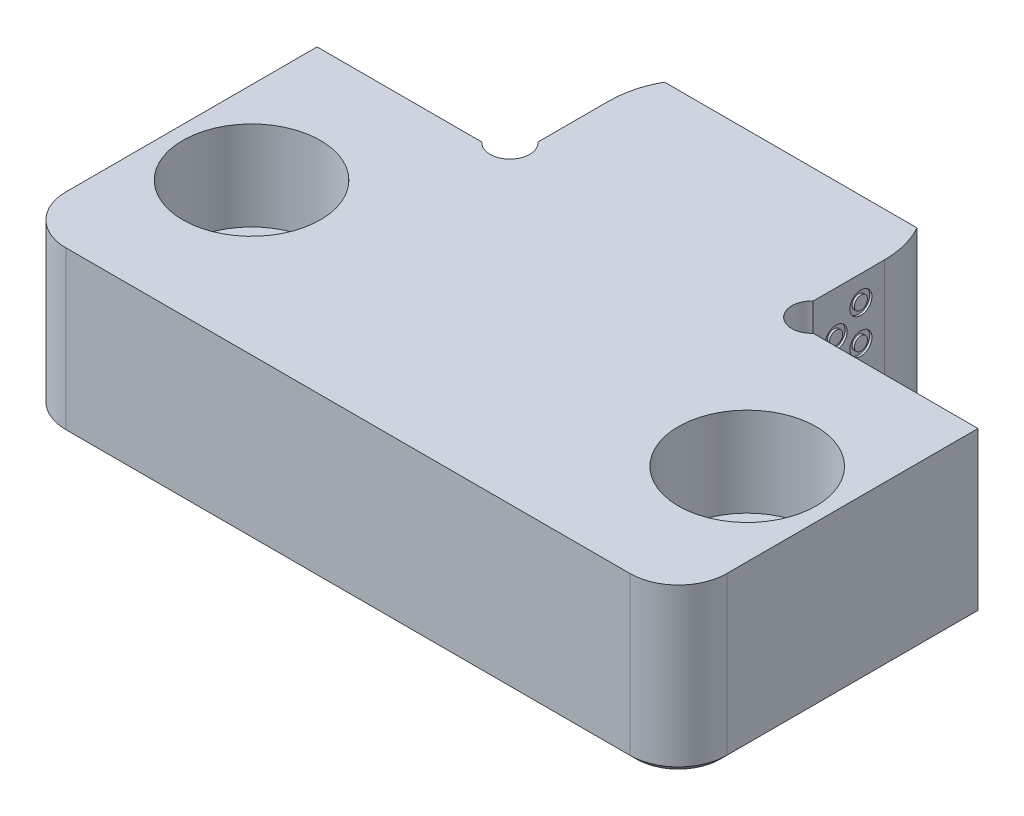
ISO-10303-21;
HEADER;
FILE_DESCRIPTION(('STEP AP214'),'2;1');
FILE_NAME('part.step','',(''),(''),'','','');
FILE_SCHEMA(('AUTOMOTIVE_DESIGN { 1 0 10303 214 1 1 1 1 }'));
ENDSEC;
DATA;
#1=APPLICATION_CONTEXT('core data for automotive mechanical design processes');
#2=APPLICATION_PROTOCOL_DEFINITION('international standard','automotive_design',2000,#1);
#3=PRODUCT_CONTEXT('',#1,'mechanical');
#4=PRODUCT('Part','Part','',(#3));
#5=PRODUCT_RELATED_PRODUCT_CATEGORY('part','',(#4));
#6=PRODUCT_DEFINITION_FORMATION('','',#4);
#7=PRODUCT_DEFINITION_CONTEXT('part definition',#1,'design');
#8=PRODUCT_DEFINITION('design','',#6,#7);
#9=PRODUCT_DEFINITION_SHAPE('','',#8);
#10=(LENGTH_UNIT() NAMED_UNIT(*) SI_UNIT(.MILLI.,.METRE.));
#11=(NAMED_UNIT(*) PLANE_ANGLE_UNIT() SI_UNIT($,.RADIAN.));
#12=(NAMED_UNIT(*) SI_UNIT($,.STERADIAN.) SOLID_ANGLE_UNIT());
#13=UNCERTAINTY_MEASURE_WITH_UNIT(LENGTH_MEASURE(1.E-05),#10,'distance_accuracy_value','');
#14=(GEOMETRIC_REPRESENTATION_CONTEXT(3) GLOBAL_UNCERTAINTY_ASSIGNED_CONTEXT((#13)) GLOBAL_UNIT_ASSIGNED_CONTEXT((#10,
#11,#12)) REPRESENTATION_CONTEXT('',''));
#15=CARTESIAN_POINT('',(0.,0.,0.));
#16=DIRECTION('',(0.,0.,1.));
#17=DIRECTION('',(1.,0.,0.));
#18=AXIS2_PLACEMENT_3D('',#15,#16,#17);
#19=CARTESIAN_POINT('',(-15.87246,-18.923,0.));
#20=DIRECTION('',(-1.,0.,0.));
#21=DIRECTION('',(0.,0.,1.));
#22=AXIS2_PLACEMENT_3D('',#19,#20,#21);
#23=PLANE('',#22);
#24=CARTESIAN_POINT('',(-15.87246,95.631,-1.27000000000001));
#25=DIRECTION('',(-1.,0.,0.));
#26=DIRECTION('',(0.,0.,1.));
#27=AXIS2_PLACEMENT_3D('',#24,#25,#26);
#28=CIRCLE('',#27,114.3);
#29=CARTESIAN_POINT('',(-15.87246,-18.6522301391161,-3.22788379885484));
#30=VERTEX_POINT('',#29);
#31=CARTESIAN_POINT('',(-15.87246,-18.216548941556,-11.43));
#32=VERTEX_POINT('',#31);
#33=EDGE_CURVE('E547',#30,#32,#28,.F.);
#34=ORIENTED_EDGE('',*,*,#33,.F.);
#35=DIRECTION('',(0.,1.,0.));
#36=VECTOR('',#35,1.);
#37=CARTESIAN_POINT('',(-15.87246,-18.923,-3.22788379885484));
#38=LINE('',#37,#36);
#39=CARTESIAN_POINT('',(-15.87246,0.,-3.22788379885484));
#40=VERTEX_POINT('',#39);
#41=EDGE_CURVE('E197',#40,#30,#38,.F.);
#42=ORIENTED_EDGE('',*,*,#41,.F.);
#43=DIRECTION('',(0.,0.,1.));
#44=VECTOR('',#43,1.);
#45=CARTESIAN_POINT('',(-15.87246,0.,0.));
#46=LINE('',#45,#44);
#47=CARTESIAN_POINT('',(-15.87246,0.,-11.43));
#48=VERTEX_POINT('',#47);
#49=EDGE_CURVE('E620',#48,#40,#46,.T.);
#50=ORIENTED_EDGE('',*,*,#49,.F.);
#51=DIRECTION('',(0.,1.,0.));
#52=VECTOR('',#51,1.);
#53=CARTESIAN_POINT('',(-15.87246,-18.923,-11.43));
#54=LINE('',#53,#52);
#55=EDGE_CURVE('E573',#32,#48,#54,.T.);
#56=ORIENTED_EDGE('',*,*,#55,.F.);
#57=EDGE_LOOP('',(#34,#42,#50,#56));
#58=FACE_BOUND('',#57,.T.);
#59=CARTESIAN_POINT('',(-15.87246,-2.91674184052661,-8.72856886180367));
#60=DIRECTION('',(1.,0.,0.));
#61=DIRECTION('',(0.,0.,-1.));
#62=AXIS2_PLACEMENT_3D('',#59,#60,#61);
#63=CIRCLE('',#62,1.27);
#64=CARTESIAN_POINT('',(-15.87246,-2.91674184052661,-9.99856886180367));
#65=VERTEX_POINT('',#64);
#66=EDGE_CURVE('E422',#65,#65,#63,.T.);
#67=ORIENTED_EDGE('',*,*,#66,.T.);
#68=EDGE_LOOP('',(#67));
#69=FACE_BOUND('',#68,.T.);
#70=CARTESIAN_POINT('',(-15.87246,-15.4535122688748,-8.72856886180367));
#71=DIRECTION('',(1.,0.,0.));
#72=DIRECTION('',(0.,0.,-1.));
#73=AXIS2_PLACEMENT_3D('',#70,#71,#72);
#74=CIRCLE('',#73,1.27);
#75=CARTESIAN_POINT('',(-15.87246,-15.4535122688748,-9.99856886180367));
#76=VERTEX_POINT('',#75);
#77=EDGE_CURVE('E406',#76,#76,#74,.T.);
#78=ORIENTED_EDGE('',*,*,#77,.T.);
#79=EDGE_LOOP('',(#78));
#80=FACE_BOUND('',#79,.T.);
#81=CARTESIAN_POINT('',(-15.87246,-11.2903583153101,-8.63395172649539));
#82=DIRECTION('',(1.,0.,0.));
#83=DIRECTION('',(0.,0.,-1.));
#84=AXIS2_PLACEMENT_3D('',#81,#82,#83);
#85=CIRCLE('',#84,1.27);
#86=CARTESIAN_POINT('',(-15.87246,-11.2903583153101,-9.90395172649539));
#87=VERTEX_POINT('',#86);
#88=EDGE_CURVE('E409',#87,#87,#85,.T.);
#89=ORIENTED_EDGE('',*,*,#88,.T.);
#90=EDGE_LOOP('',(#89));
#91=FACE_BOUND('',#90,.T.);
#92=CARTESIAN_POINT('',(-15.87246,-6.985278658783,-8.72856886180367));
#93=DIRECTION('',(1.,0.,0.));
#94=DIRECTION('',(0.,0.,-1.));
#95=AXIS2_PLACEMENT_3D('',#92,#93,#94);
#96=CIRCLE('',#95,1.27);
#97=CARTESIAN_POINT('',(-15.87246,-6.985278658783,-9.99856886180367));
#98=VERTEX_POINT('',#97);
#99=EDGE_CURVE('E1350',#98,#98,#96,.T.);
#100=ORIENTED_EDGE('',*,*,#99,.T.);
#101=EDGE_LOOP('',(#100));
#102=FACE_BOUND('',#101,.T.);
#103=CARTESIAN_POINT('',(-15.87246,-4.99176088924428,-5.86933033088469));
#104=DIRECTION('',(1.,0.,0.));
#105=DIRECTION('',(0.,0.,-1.));
#106=AXIS2_PLACEMENT_3D('',#103,#104,#105);
#107=CIRCLE('',#106,1.27);
#108=CARTESIAN_POINT('',(-15.87246,-4.99176088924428,-7.13933033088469));
#109=VERTEX_POINT('',#108);
#110=EDGE_CURVE('E1338',#109,#109,#107,.T.);
#111=ORIENTED_EDGE('',*,*,#110,.T.);
#112=EDGE_LOOP('',(#111));
#113=FACE_BOUND('',#112,.T.);
#114=CARTESIAN_POINT('',(-15.87246,-13.3653773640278,-5.77471319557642));
#115=DIRECTION('',(1.,0.,0.));
#116=DIRECTION('',(0.,0.,-1.));
#117=AXIS2_PLACEMENT_3D('',#114,#115,#116);
#118=CIRCLE('',#117,1.27);
#119=CARTESIAN_POINT('',(-15.87246,-13.3653773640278,-7.04471319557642));
#120=VERTEX_POINT('',#119);
#121=EDGE_CURVE('E1326',#120,#120,#118,.T.);
#122=ORIENTED_EDGE('',*,*,#121,.T.);
#123=EDGE_LOOP('',(#122));
#124=FACE_BOUND('',#123,.T.);
#125=CARTESIAN_POINT('',(-15.87246,-9.06029770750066,-5.86933033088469));
#126=DIRECTION('',(1.,0.,0.));
#127=DIRECTION('',(0.,0.,-1.));
#128=AXIS2_PLACEMENT_3D('',#125,#126,#127);
#129=CIRCLE('',#128,1.27);
#130=CARTESIAN_POINT('',(-15.87246,-9.06029770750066,-7.13933033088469));
#131=VERTEX_POINT('',#130);
#132=EDGE_CURVE('E1312',#131,#131,#129,.T.);
#133=ORIENTED_EDGE('',*,*,#132,.T.);
#134=EDGE_LOOP('',(#133));
#135=FACE_BOUND('',#134,.T.);
#136=ADVANCED_FACE('F34',(#58,#69,#80,#91,#102,#113,#124,#135),#23,.T.);
#137=CARTESIAN_POINT('',(-5.37464,-18.923,-11.43));
#138=DIRECTION('',(0.,1.,0.));
#139=DIRECTION('',(0.,0.,1.));
#140=AXIS2_PLACEMENT_3D('',#137,#138,#139);
#141=CYLINDRICAL_SURFACE('',#140,10.49782);
#142=CARTESIAN_POINT('',(-15.87246,-18.216548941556,-11.43));
#143=CARTESIAN_POINT('',(-15.8724931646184,-18.1897990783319,-11.7298822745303));
#144=CARTESIAN_POINT('',(-15.8596118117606,-18.1618410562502,-12.0296494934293));
#145=CARTESIAN_POINT('',(-15.8083060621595,-18.1037825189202,-12.6268717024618));
#146=CARTESIAN_POINT('',(-15.7698742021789,-18.0736813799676,-12.9243259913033));
#147=CARTESIAN_POINT('',(-15.668808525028,-18.0122673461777,-13.508564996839));
#148=CARTESIAN_POINT('',(-15.6066910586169,-17.9809923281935,-13.795443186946));
#149=CARTESIAN_POINT('',(-15.4587486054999,-17.9170164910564,-14.3627221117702));
#150=CARTESIAN_POINT('',(-15.3729340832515,-17.8843163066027,-14.6431256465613));
#151=CARTESIAN_POINT('',(-15.1793366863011,-17.8182454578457,-15.192436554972));
#152=CARTESIAN_POINT('',(-15.0718215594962,-17.7848870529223,-15.4614398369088));
#153=CARTESIAN_POINT('',(-14.8337570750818,-17.717204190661,-15.9923447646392));
#154=CARTESIAN_POINT('',(-14.7029794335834,-17.6828732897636,-16.2541432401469));
#155=CARTESIAN_POINT('',(-14.5614688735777,-17.648443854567,-16.51));
#156=B_SPLINE_CURVE_WITH_KNOTS('',3,(#142,#143,#144,#145,#146,#147,#148,#149,#150,#151,#152,
#153,#154,#155),.UNSPECIFIED.,.F.,.F.,(4,2,2,2,2,2,4),(0.,0.902932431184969,1.80612872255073,
2.69066728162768,3.57481585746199,4.44865784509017,5.33160277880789),.UNSPECIFIED.);
#157=CARTESIAN_POINT('',(-14.5614688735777,-17.648443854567,-16.51));
#158=VERTEX_POINT('',#157);
#159=EDGE_CURVE('E221',#32,#158,#156,.T.);
#160=ORIENTED_EDGE('',*,*,#159,.F.);
#161=ORIENTED_EDGE('',*,*,#55,.T.);
#162=CARTESIAN_POINT('',(-5.37464,0.,-11.43));
#163=DIRECTION('',(0.,1.,0.));
#164=DIRECTION('',(0.,0.,1.));
#165=AXIS2_PLACEMENT_3D('',#162,#163,#164);
#166=CIRCLE('',#165,10.49782);
#167=CARTESIAN_POINT('',(-14.5614688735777,0.,-16.51));
#168=VERTEX_POINT('',#167);
#169=EDGE_CURVE('E618',#168,#48,#166,.T.);
#170=ORIENTED_EDGE('',*,*,#169,.F.);
#171=DIRECTION('',(0.,1.,0.));
#172=VECTOR('',#171,1.);
#173=CARTESIAN_POINT('',(-14.5614688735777,-18.923,-16.51));
#174=LINE('',#173,#172);
#175=EDGE_CURVE('E563',#158,#168,#174,.T.);
#176=ORIENTED_EDGE('',*,*,#175,.F.);
#177=EDGE_LOOP('',(#160,#161,#170,#176));
#178=FACE_BOUND('',#177,.T.);
#179=ADVANCED_FACE('F277',(#178),#141,.T.);
#180=CARTESIAN_POINT('',(-14.5614688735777,-18.923,-16.51));
#181=DIRECTION('',(0.,0.,-1.));
#182=DIRECTION('',(-1.,0.,0.));
#183=AXIS2_PLACEMENT_3D('',#180,#181,#182);
#184=PLANE('',#183);
#185=DIRECTION('',(1.,0.,0.));
#186=VECTOR('',#185,1.);
#187=CARTESIAN_POINT('',(-38.1,-17.648443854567,-16.51));
#188=LINE('',#187,#186);
#189=CARTESIAN_POINT('',(14.5614688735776,-17.648443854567,-16.51));
#190=VERTEX_POINT('',#189);
#191=EDGE_CURVE('E236',#158,#190,#188,.T.);
#192=ORIENTED_EDGE('',*,*,#191,.F.);
#193=ORIENTED_EDGE('',*,*,#175,.T.);
#194=DIRECTION('',(-1.,0.,0.));
#195=VECTOR('',#194,1.);
#196=CARTESIAN_POINT('',(-14.5614688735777,0.,-16.51));
#197=LINE('',#196,#195);
#198=CARTESIAN_POINT('',(14.5614688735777,0.,-16.51));
#199=VERTEX_POINT('',#198);
#200=EDGE_CURVE('E562',#199,#168,#197,.T.);
#201=ORIENTED_EDGE('',*,*,#200,.F.);
#202=DIRECTION('',(0.,1.,0.));
#203=VECTOR('',#202,1.);
#204=CARTESIAN_POINT('',(14.5614688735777,-18.923,-16.51));
#205=LINE('',#204,#203);
#206=EDGE_CURVE('E557',#190,#199,#205,.T.);
#207=ORIENTED_EDGE('',*,*,#206,.F.);
#208=EDGE_LOOP('',(#192,#193,#201,#207));
#209=FACE_BOUND('',#208,.T.);
#210=ADVANCED_FACE('F243',(#209),#184,.T.);
#211=CARTESIAN_POINT('',(5.37464,-18.923,-11.43));
#212=DIRECTION('',(0.,1.,0.));
#213=DIRECTION('',(0.,0.,1.));
#214=AXIS2_PLACEMENT_3D('',#211,#212,#213);
#215=CYLINDRICAL_SURFACE('',#214,10.49782);
#216=CARTESIAN_POINT('',(14.5614688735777,-17.648443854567,-16.51));
#217=CARTESIAN_POINT('',(14.7061867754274,-17.6836535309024,-16.2483510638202));
#218=CARTESIAN_POINT('',(14.8396791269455,-17.7187601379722,-15.9804798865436));
#219=CARTESIAN_POINT('',(15.0834132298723,-17.788319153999,-15.4341573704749));
#220=CARTESIAN_POINT('',(15.1936463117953,-17.8227713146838,-15.1557021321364));
#221=CARTESIAN_POINT('',(15.3879193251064,-17.8898442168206,-14.5961323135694));
#222=CARTESIAN_POINT('',(15.4724547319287,-17.9224881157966,-14.3151924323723));
#223=CARTESIAN_POINT('',(15.6177208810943,-17.9863013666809,-13.747197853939));
#224=CARTESIAN_POINT('',(15.6784626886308,-18.0174713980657,-13.4601460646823));
#225=CARTESIAN_POINT('',(15.7751513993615,-18.077663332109,-12.8851748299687));
#226=CARTESIAN_POINT('',(15.8113807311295,-18.106706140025,-12.5973050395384));
#227=CARTESIAN_POINT('',(15.8601750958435,-18.1630807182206,-12.0163442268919));
#228=CARTESIAN_POINT('',(15.8724890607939,-18.1903914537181,-11.7232300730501));
#229=CARTESIAN_POINT('',(15.87246,-18.216548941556,-11.43));
#230=B_SPLINE_CURVE_WITH_KNOTS('',3,(#216,#217,#218,#219,#220,#221,#222,#223,#224,#225,#226,
#227,#228,#229),.UNSPECIFIED.,.F.,.F.,(4,2,2,2,2,2,4),(0.,0.902941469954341,1.80621890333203,
2.69077715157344,3.57492354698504,4.44870109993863,5.3316031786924),.UNSPECIFIED.);
#231=CARTESIAN_POINT('',(15.87246,-18.216548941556,-11.43));
#232=VERTEX_POINT('',#231);
#233=EDGE_CURVE('E229',#190,#232,#230,.T.);
#234=ORIENTED_EDGE('',*,*,#233,.F.);
#235=ORIENTED_EDGE('',*,*,#206,.T.);
#236=CARTESIAN_POINT('',(5.37464,0.,-11.43));
#237=DIRECTION('',(0.,1.,0.));
#238=DIRECTION('',(0.,0.,-1.));
#239=AXIS2_PLACEMENT_3D('',#236,#237,#238);
#240=CIRCLE('',#239,10.49782);
#241=CARTESIAN_POINT('',(15.87246,0.,-11.43));
#242=VERTEX_POINT('',#241);
#243=EDGE_CURVE('E602',#242,#199,#240,.T.);
#244=ORIENTED_EDGE('',*,*,#243,.F.);
#245=DIRECTION('',(0.,1.,0.));
#246=VECTOR('',#245,1.);
#247=CARTESIAN_POINT('',(15.87246,-18.923,-11.43));
#248=LINE('',#247,#246);
#249=EDGE_CURVE('E559',#232,#242,#248,.T.);
#250=ORIENTED_EDGE('',*,*,#249,.F.);
#251=EDGE_LOOP('',(#234,#235,#244,#250));
#252=FACE_BOUND('',#251,.T.);
#253=ADVANCED_FACE('F237',(#252),#215,.T.);
#254=CARTESIAN_POINT('',(15.87246,-18.923,-11.43));
#255=DIRECTION('',(1.,0.,0.));
#256=DIRECTION('',(0.,0.,-1.));
#257=AXIS2_PLACEMENT_3D('',#254,#255,#256);
#258=PLANE('',#257);
#259=CARTESIAN_POINT('',(15.87246,-9.06029770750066,-5.86933033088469));
#260=DIRECTION('',(1.,0.,0.));
#261=DIRECTION('',(0.,0.,-1.));
#262=AXIS2_PLACEMENT_3D('',#259,#260,#261);
#263=CIRCLE('',#262,1.27);
#264=CARTESIAN_POINT('',(15.87246,-9.06029770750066,-7.13933033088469));
#265=VERTEX_POINT('',#264);
#266=EDGE_CURVE('E434',#265,#265,#263,.T.);
#267=ORIENTED_EDGE('',*,*,#266,.F.);
#268=EDGE_LOOP('',(#267));
#269=FACE_BOUND('',#268,.T.);
#270=CARTESIAN_POINT('',(15.87246,-13.3653773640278,-5.77471319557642));
#271=DIRECTION('',(1.,0.,0.));
#272=DIRECTION('',(0.,0.,-1.));
#273=AXIS2_PLACEMENT_3D('',#270,#271,#272);
#274=CIRCLE('',#273,1.27);
#275=CARTESIAN_POINT('',(15.87246,-13.3653773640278,-7.04471319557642));
#276=VERTEX_POINT('',#275);
#277=EDGE_CURVE('E446',#276,#276,#274,.T.);
#278=ORIENTED_EDGE('',*,*,#277,.F.);
#279=EDGE_LOOP('',(#278));
#280=FACE_BOUND('',#279,.T.);
#281=CARTESIAN_POINT('',(15.87246,-4.99176088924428,-5.86933033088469));
#282=DIRECTION('',(1.,0.,0.));
#283=DIRECTION('',(0.,0.,-1.));
#284=AXIS2_PLACEMENT_3D('',#281,#282,#283);
#285=CIRCLE('',#284,1.27);
#286=CARTESIAN_POINT('',(15.87246,-4.99176088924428,-7.13933033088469));
#287=VERTEX_POINT('',#286);
#288=EDGE_CURVE('E458',#287,#287,#285,.T.);
#289=ORIENTED_EDGE('',*,*,#288,.F.);
#290=EDGE_LOOP('',(#289));
#291=FACE_BOUND('',#290,.T.);
#292=CARTESIAN_POINT('',(15.87246,-6.985278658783,-8.72856886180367));
#293=DIRECTION('',(1.,0.,0.));
#294=DIRECTION('',(0.,0.,-1.));
#295=AXIS2_PLACEMENT_3D('',#292,#293,#294);
#296=CIRCLE('',#295,1.27);
#297=CARTESIAN_POINT('',(15.87246,-6.985278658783,-9.99856886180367));
#298=VERTEX_POINT('',#297);
#299=EDGE_CURVE('E470',#298,#298,#296,.T.);
#300=ORIENTED_EDGE('',*,*,#299,.F.);
#301=EDGE_LOOP('',(#300));
#302=FACE_BOUND('',#301,.T.);
#303=CARTESIAN_POINT('',(15.87246,-11.2903583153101,-8.63395172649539));
#304=DIRECTION('',(1.,0.,0.));
#305=DIRECTION('',(0.,0.,-1.));
#306=AXIS2_PLACEMENT_3D('',#303,#304,#305);
#307=CIRCLE('',#306,1.27);
#308=CARTESIAN_POINT('',(15.87246,-11.2903583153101,-9.90395172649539));
#309=VERTEX_POINT('',#308);
#310=EDGE_CURVE('E482',#309,#309,#307,.T.);
#311=ORIENTED_EDGE('',*,*,#310,.F.);
#312=EDGE_LOOP('',(#311));
#313=FACE_BOUND('',#312,.T.);
#314=CARTESIAN_POINT('',(15.87246,-15.4535122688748,-8.72856886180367));
#315=DIRECTION('',(1.,0.,0.));
#316=DIRECTION('',(0.,0.,-1.));
#317=AXIS2_PLACEMENT_3D('',#314,#315,#316);
#318=CIRCLE('',#317,1.27);
#319=CARTESIAN_POINT('',(15.87246,-15.4535122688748,-9.99856886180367));
#320=VERTEX_POINT('',#319);
#321=EDGE_CURVE('E494',#320,#320,#318,.T.);
#322=ORIENTED_EDGE('',*,*,#321,.F.);
#323=EDGE_LOOP('',(#322));
#324=FACE_BOUND('',#323,.T.);
#325=CARTESIAN_POINT('',(15.87246,-2.91674184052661,-8.72856886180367));
#326=DIRECTION('',(1.,0.,0.));
#327=DIRECTION('',(0.,0.,-1.));
#328=AXIS2_PLACEMENT_3D('',#325,#326,#327);
#329=CIRCLE('',#328,1.27);
#330=CARTESIAN_POINT('',(15.87246,-2.91674184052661,-9.99856886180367));
#331=VERTEX_POINT('',#330);
#332=EDGE_CURVE('E506',#331,#331,#329,.T.);
#333=ORIENTED_EDGE('',*,*,#332,.F.);
#334=EDGE_LOOP('',(#333));
#335=FACE_BOUND('',#334,.T.);
#336=CARTESIAN_POINT('',(15.87246,95.631,-1.27000000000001));
#337=DIRECTION('',(1.,0.,0.));
#338=DIRECTION('',(0.,0.,-1.));
#339=AXIS2_PLACEMENT_3D('',#336,#337,#338);
#340=CIRCLE('',#339,114.3);
#341=CARTESIAN_POINT('',(15.87246,-18.6522301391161,-3.22788379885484));
#342=VERTEX_POINT('',#341);
#343=EDGE_CURVE('E235',#232,#342,#340,.F.);
#344=ORIENTED_EDGE('',*,*,#343,.F.);
#345=ORIENTED_EDGE('',*,*,#249,.T.);
#346=DIRECTION('',(0.,0.,-1.));
#347=VECTOR('',#346,1.);
#348=CARTESIAN_POINT('',(15.87246,0.,-11.43));
#349=LINE('',#348,#347);
#350=CARTESIAN_POINT('',(15.87246,0.,-3.22788379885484));
#351=VERTEX_POINT('',#350);
#352=EDGE_CURVE('E600',#351,#242,#349,.T.);
#353=ORIENTED_EDGE('',*,*,#352,.F.);
#354=DIRECTION('',(0.,1.,0.));
#355=VECTOR('',#354,1.);
#356=CARTESIAN_POINT('',(15.87246,-18.923,-3.22788379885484));
#357=LINE('',#356,#355);
#358=EDGE_CURVE('E585',#342,#351,#357,.T.);
#359=ORIENTED_EDGE('',*,*,#358,.F.);
#360=EDGE_LOOP('',(#344,#345,#353,#359));
#361=FACE_BOUND('',#360,.T.);
#362=ADVANCED_FACE('F242',(#269,#280,#291,#302,#313,#324,#335,#361),#258,.T.);
#363=CARTESIAN_POINT('',(15.87246,-18.923,0.));
#364=DIRECTION('',(0.,0.,-1.));
#365=DIRECTION('',(-1.,0.,0.));
#366=AXIS2_PLACEMENT_3D('',#363,#364,#365);
#367=PLANE('',#366);
#368=DIRECTION('',(0.,1.,0.));
#369=VECTOR('',#368,1.);
#370=CARTESIAN_POINT('',(38.1,-18.923,0.));
#371=LINE('',#370,#369);
#372=CARTESIAN_POINT('',(38.1,-18.161,0.));
#373=VERTEX_POINT('',#372);
#374=CARTESIAN_POINT('',(38.1,0.,0.));
#375=VERTEX_POINT('',#374);
#376=EDGE_CURVE('E566',#373,#375,#371,.T.);
#377=ORIENTED_EDGE('',*,*,#376,.F.);
#378=DIRECTION('',(-0.707106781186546,-0.707106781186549,0.));
#379=VECTOR('',#378,1.);
#380=CARTESIAN_POINT('',(26.60523,-29.65577,0.));
#381=LINE('',#380,#379);
#382=CARTESIAN_POINT('',(37.338,-18.923,0.));
#383=VERTEX_POINT('',#382);
#384=EDGE_CURVE('E11',#373,#383,#381,.T.);
#385=ORIENTED_EDGE('',*,*,#384,.T.);
#386=DIRECTION('',(-1.,0.,0.));
#387=VECTOR('',#386,1.);
#388=CARTESIAN_POINT('',(15.87246,-18.923,0.));
#389=LINE('',#388,#387);
#390=CARTESIAN_POINT('',(19.1003437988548,-18.923,0.));
#391=VERTEX_POINT('',#390);
#392=EDGE_CURVE('E575',#383,#391,#389,.T.);
#393=ORIENTED_EDGE('',*,*,#392,.T.);
#394=DIRECTION('',(0.,1.,0.));
#395=VECTOR('',#394,1.);
#396=CARTESIAN_POINT('',(19.1003437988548,-18.923,0.));
#397=LINE('',#396,#395);
#398=CARTESIAN_POINT('',(19.1003437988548,0.,0.));
#399=VERTEX_POINT('',#398);
#400=EDGE_CURVE('E582',#399,#391,#397,.F.);
#401=ORIENTED_EDGE('',*,*,#400,.F.);
#402=DIRECTION('',(-1.,0.,0.));
#403=VECTOR('',#402,1.);
#404=CARTESIAN_POINT('',(15.87246,0.,0.));
#405=LINE('',#404,#403);
#406=EDGE_CURVE('E591',#375,#399,#405,.T.);
#407=ORIENTED_EDGE('',*,*,#406,.F.);
#408=EDGE_LOOP('',(#377,#385,#393,#401,#407));
#409=FACE_BOUND('',#408,.T.);
#410=ADVANCED_FACE('F248',(#409),#367,.T.);
#411=CARTESIAN_POINT('',(38.1,-18.923,0.));
#412=DIRECTION('',(1.,0.,0.));
#413=DIRECTION('',(0.,0.,-1.));
#414=AXIS2_PLACEMENT_3D('',#411,#412,#413);
#415=PLANE('',#414);
#416=DIRECTION('',(0.,1.,0.));
#417=VECTOR('',#416,1.);
#418=CARTESIAN_POINT('',(38.1,-18.923,28.956));
#419=LINE('',#418,#417);
#420=CARTESIAN_POINT('',(38.1,0.,28.956));
#421=VERTEX_POINT('',#420);
#422=CARTESIAN_POINT('',(38.1,-18.161,28.956));
#423=VERTEX_POINT('',#422);
#424=EDGE_CURVE('E640',#421,#423,#419,.F.);
#425=ORIENTED_EDGE('',*,*,#424,.T.);
#426=DIRECTION('',(0.,0.,-1.));
#427=VECTOR('',#426,1.);
#428=CARTESIAN_POINT('',(38.1,-18.161,0.));
#429=LINE('',#428,#427);
#430=EDGE_CURVE('E43',#423,#373,#429,.T.);
#431=ORIENTED_EDGE('',*,*,#430,.T.);
#432=ORIENTED_EDGE('',*,*,#376,.T.);
#433=DIRECTION('',(0.,0.,-1.));
#434=VECTOR('',#433,1.);
#435=CARTESIAN_POINT('',(38.1,0.,0.));
#436=LINE('',#435,#434);
#437=EDGE_CURVE('E599',#421,#375,#436,.T.);
#438=ORIENTED_EDGE('',*,*,#437,.F.);
#439=EDGE_LOOP('',(#425,#431,#432,#438));
#440=FACE_BOUND('',#439,.T.);
#441=ADVANCED_FACE('F254',(#440),#415,.T.);
#442=CARTESIAN_POINT('',(-38.1,-18.923,34.544));
#443=DIRECTION('',(0.,0.,1.));
#444=DIRECTION('',(1.,0.,0.));
#445=AXIS2_PLACEMENT_3D('',#442,#443,#444);
#446=PLANE('',#445);
#447=DIRECTION('',(0.,1.,0.));
#448=VECTOR('',#447,1.);
#449=CARTESIAN_POINT('',(-32.512,-18.923,34.544));
#450=LINE('',#449,#448);
#451=CARTESIAN_POINT('',(-32.512,0.,34.544));
#452=VERTEX_POINT('',#451);
#453=CARTESIAN_POINT('',(-32.512,-18.161,34.544));
#454=VERTEX_POINT('',#453);
#455=EDGE_CURVE('E634',#452,#454,#450,.F.);
#456=ORIENTED_EDGE('',*,*,#455,.T.);
#457=DIRECTION('',(1.,0.,0.));
#458=VECTOR('',#457,1.);
#459=CARTESIAN_POINT('',(32.512,-18.161,34.544));
#460=LINE('',#459,#458);
#461=CARTESIAN_POINT('',(32.512,-18.161,34.544));
#462=VERTEX_POINT('',#461);
#463=EDGE_CURVE('E662',#454,#462,#460,.T.);
#464=ORIENTED_EDGE('',*,*,#463,.T.);
#465=DIRECTION('',(0.,1.,0.));
#466=VECTOR('',#465,1.);
#467=CARTESIAN_POINT('',(32.512,-18.923,34.544));
#468=LINE('',#467,#466);
#469=CARTESIAN_POINT('',(32.512,0.,34.544));
#470=VERTEX_POINT('',#469);
#471=EDGE_CURVE('E636',#462,#470,#468,.T.);
#472=ORIENTED_EDGE('',*,*,#471,.T.);
#473=DIRECTION('',(1.,0.,0.));
#474=VECTOR('',#473,1.);
#475=CARTESIAN_POINT('',(-38.1,0.,34.544));
#476=LINE('',#475,#474);
#477=EDGE_CURVE('E604',#452,#470,#476,.T.);
#478=ORIENTED_EDGE('',*,*,#477,.F.);
#479=EDGE_LOOP('',(#456,#464,#472,#478));
#480=FACE_BOUND('',#479,.T.);
#481=ADVANCED_FACE('F258',(#480),#446,.T.);
#482=CARTESIAN_POINT('',(-38.1,-18.923,0.));
#483=DIRECTION('',(-1.,0.,0.));
#484=DIRECTION('',(0.,0.,1.));
#485=AXIS2_PLACEMENT_3D('',#482,#483,#484);
#486=PLANE('',#485);
#487=DIRECTION('',(0.,1.,0.));
#488=VECTOR('',#487,1.);
#489=CARTESIAN_POINT('',(-38.1,-18.923,0.));
#490=LINE('',#489,#488);
#491=CARTESIAN_POINT('',(-38.1,-18.161,0.));
#492=VERTEX_POINT('',#491);
#493=CARTESIAN_POINT('',(-38.1,0.,0.));
#494=VERTEX_POINT('',#493);
#495=EDGE_CURVE('E571',#492,#494,#490,.T.);
#496=ORIENTED_EDGE('',*,*,#495,.F.);
#497=DIRECTION('',(0.,0.,1.));
#498=VECTOR('',#497,1.);
#499=CARTESIAN_POINT('',(-38.1,-18.161,28.956));
#500=LINE('',#499,#498);
#501=CARTESIAN_POINT('',(-38.1,-18.161,28.956));
#502=VERTEX_POINT('',#501);
#503=EDGE_CURVE('E642',#492,#502,#500,.T.);
#504=ORIENTED_EDGE('',*,*,#503,.T.);
#505=DIRECTION('',(0.,1.,0.));
#506=VECTOR('',#505,1.);
#507=CARTESIAN_POINT('',(-38.1,-18.923,28.956));
#508=LINE('',#507,#506);
#509=CARTESIAN_POINT('',(-38.1,0.,28.956));
#510=VERTEX_POINT('',#509);
#511=EDGE_CURVE('E198',#502,#510,#508,.T.);
#512=ORIENTED_EDGE('',*,*,#511,.T.);
#513=DIRECTION('',(0.,0.,1.));
#514=VECTOR('',#513,1.);
#515=CARTESIAN_POINT('',(-38.1,0.,0.));
#516=LINE('',#515,#514);
#517=EDGE_CURVE('E626',#494,#510,#516,.T.);
#518=ORIENTED_EDGE('',*,*,#517,.F.);
#519=EDGE_LOOP('',(#496,#504,#512,#518));
#520=FACE_BOUND('',#519,.T.);
#521=ADVANCED_FACE('F261',(#520),#486,.T.);
#522=CARTESIAN_POINT('',(-15.87246,-18.923,0.));
#523=DIRECTION('',(0.,0.,-1.));
#524=DIRECTION('',(-1.,0.,0.));
#525=AXIS2_PLACEMENT_3D('',#522,#523,#524);
#526=PLANE('',#525);
#527=DIRECTION('',(-1.,0.,0.));
#528=VECTOR('',#527,1.);
#529=CARTESIAN_POINT('',(-15.87246,-18.923,0.));
#530=LINE('',#529,#528);
#531=CARTESIAN_POINT('',(-19.1003437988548,-18.923,0.));
#532=VERTEX_POINT('',#531);
#533=CARTESIAN_POINT('',(-37.338,-18.923,0.));
#534=VERTEX_POINT('',#533);
#535=EDGE_CURVE('E608',#532,#534,#530,.T.);
#536=ORIENTED_EDGE('',*,*,#535,.T.);
#537=DIRECTION('',(-0.707106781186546,0.707106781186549,0.));
#538=VECTOR('',#537,1.);
#539=CARTESIAN_POINT('',(-26.60523,-29.65577,0.));
#540=LINE('',#539,#538);
#541=EDGE_CURVE('E659',#534,#492,#540,.T.);
#542=ORIENTED_EDGE('',*,*,#541,.T.);
#543=ORIENTED_EDGE('',*,*,#495,.T.);
#544=DIRECTION('',(-1.,0.,0.));
#545=VECTOR('',#544,1.);
#546=CARTESIAN_POINT('',(-15.87246,0.,0.));
#547=LINE('',#546,#545);
#548=CARTESIAN_POINT('',(-19.1003437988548,0.,0.));
#549=VERTEX_POINT('',#548);
#550=EDGE_CURVE('E623',#549,#494,#547,.T.);
#551=ORIENTED_EDGE('',*,*,#550,.F.);
#552=DIRECTION('',(0.,1.,0.));
#553=VECTOR('',#552,1.);
#554=CARTESIAN_POINT('',(-19.1003437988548,-18.923,0.));
#555=LINE('',#554,#553);
#556=EDGE_CURVE('E679',#532,#549,#555,.T.);
#557=ORIENTED_EDGE('',*,*,#556,.F.);
#558=EDGE_LOOP('',(#536,#542,#543,#551,#557));
#559=FACE_BOUND('',#558,.T.);
#560=ADVANCED_FACE('F265',(#559),#526,.T.);
#561=CARTESIAN_POINT('',(-5.37464,-18.923,-11.43));
#562=DIRECTION('',(0.,1.,0.));
#563=DIRECTION('',(0.,0.,1.));
#564=AXIS2_PLACEMENT_3D('',#561,#562,#563);
#565=PLANE('',#564);
#566=CARTESIAN_POINT('',(-28.575,-18.923,17.0815));
#567=DIRECTION('',(0.,1.,0.));
#568=DIRECTION('',(0.,0.,1.));
#569=AXIS2_PLACEMENT_3D('',#566,#567,#568);
#570=CIRCLE('',#569,5.15873999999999);
#571=CARTESIAN_POINT('',(-28.575,-18.923,22.24024));
#572=VERTEX_POINT('',#571);
#573=EDGE_CURVE('E523',#572,#572,#570,.T.);
#574=ORIENTED_EDGE('',*,*,#573,.T.);
#575=EDGE_LOOP('',(#574));
#576=FACE_BOUND('',#575,.T.);
#577=CARTESIAN_POINT('',(28.575,-18.923,17.0815));
#578=DIRECTION('',(0.,1.,0.));
#579=DIRECTION('',(0.,0.,1.));
#580=AXIS2_PLACEMENT_3D('',#577,#578,#579);
#581=CIRCLE('',#580,5.15873999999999);
#582=CARTESIAN_POINT('',(28.575,-18.923,22.24024));
#583=VERTEX_POINT('',#582);
#584=EDGE_CURVE('E535',#583,#583,#581,.T.);
#585=ORIENTED_EDGE('',*,*,#584,.T.);
#586=EDGE_LOOP('',(#585));
#587=FACE_BOUND('',#586,.T.);
#588=CARTESIAN_POINT('',(-32.512,-18.923,28.956));
#589=DIRECTION('',(0.,1.,0.));
#590=DIRECTION('',(0.,0.,1.));
#591=AXIS2_PLACEMENT_3D('',#588,#589,#590);
#592=CIRCLE('',#591,4.826);
#593=CARTESIAN_POINT('',(-32.512,-18.923,33.782));
#594=VERTEX_POINT('',#593);
#595=CARTESIAN_POINT('',(-37.338,-18.923,28.956));
#596=VERTEX_POINT('',#595);
#597=EDGE_CURVE('E655',#594,#596,#592,.F.);
#598=ORIENTED_EDGE('',*,*,#597,.T.);
#599=DIRECTION('',(0.,0.,-1.));
#600=VECTOR('',#599,1.);
#601=CARTESIAN_POINT('',(-37.338,-18.923,0.));
#602=LINE('',#601,#600);
#603=EDGE_CURVE('E657',#596,#534,#602,.T.);
#604=ORIENTED_EDGE('',*,*,#603,.T.);
#605=ORIENTED_EDGE('',*,*,#535,.F.);
#606=CARTESIAN_POINT('',(-17.39646,-18.923,-1.524));
#607=DIRECTION('',(0.,1.,0.));
#608=DIRECTION('',(0.,0.,-1.));
#609=AXIS2_PLACEMENT_3D('',#606,#607,#608);
#610=CIRCLE('',#609,2.286);
#611=CARTESIAN_POINT('',(-15.6925762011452,-18.923,0.));
#612=VERTEX_POINT('',#611);
#613=EDGE_CURVE('E684',#532,#612,#610,.T.);
#614=ORIENTED_EDGE('',*,*,#613,.T.);
#615=DIRECTION('',(1.,0.,0.));
#616=VECTOR('',#615,1.);
#617=CARTESIAN_POINT('',(-5.37464,-18.923,0.));
#618=LINE('',#617,#616);
#619=CARTESIAN_POINT('',(15.6925762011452,-18.923,0.));
#620=VERTEX_POINT('',#619);
#621=EDGE_CURVE('E542',#612,#620,#618,.T.);
#622=ORIENTED_EDGE('',*,*,#621,.T.);
#623=CARTESIAN_POINT('',(17.39646,-18.923,-1.524));
#624=DIRECTION('',(0.,1.,0.));
#625=DIRECTION('',(0.,0.,1.));
#626=AXIS2_PLACEMENT_3D('',#623,#624,#625);
#627=CIRCLE('',#626,2.286);
#628=EDGE_CURVE('E593',#620,#391,#627,.T.);
#629=ORIENTED_EDGE('',*,*,#628,.T.);
#630=ORIENTED_EDGE('',*,*,#392,.F.);
#631=DIRECTION('',(0.,0.,1.));
#632=VECTOR('',#631,1.);
#633=CARTESIAN_POINT('',(37.338,-18.923,28.956));
#634=LINE('',#633,#632);
#635=CARTESIAN_POINT('',(37.338,-18.923,28.956));
#636=VERTEX_POINT('',#635);
#637=EDGE_CURVE('E649',#383,#636,#634,.T.);
#638=ORIENTED_EDGE('',*,*,#637,.T.);
#639=CARTESIAN_POINT('',(32.512,-18.923,28.956));
#640=DIRECTION('',(0.,1.,0.));
#641=DIRECTION('',(0.,0.,1.));
#642=AXIS2_PLACEMENT_3D('',#639,#640,#641);
#643=CIRCLE('',#642,4.826);
#644=CARTESIAN_POINT('',(32.512,-18.923,33.782));
#645=VERTEX_POINT('',#644);
#646=EDGE_CURVE('E651',#636,#645,#643,.F.);
#647=ORIENTED_EDGE('',*,*,#646,.T.);
#648=DIRECTION('',(-1.,0.,0.));
#649=VECTOR('',#648,1.);
#650=CARTESIAN_POINT('',(-32.512,-18.923,33.782));
#651=LINE('',#650,#649);
#652=EDGE_CURVE('E653',#645,#594,#651,.T.);
#653=ORIENTED_EDGE('',*,*,#652,.T.);
#654=EDGE_LOOP('',(#598,#604,#605,#614,#622,#629,#630,#638,#647,#653));
#655=FACE_BOUND('',#654,.T.);
#656=ADVANCED_FACE('F269',(#576,#587,#655),#565,.F.);
#657=CARTESIAN_POINT('',(-5.37464,0.,-11.43));
#658=DIRECTION('',(0.,1.,0.));
#659=DIRECTION('',(0.,0.,1.));
#660=AXIS2_PLACEMENT_3D('',#657,#658,#659);
#661=PLANE('',#660);
#662=CARTESIAN_POINT('',(-28.575,0.,17.0815));
#663=DIRECTION('',(0.,1.,0.));
#664=DIRECTION('',(0.,0.,1.));
#665=AXIS2_PLACEMENT_3D('',#662,#663,#664);
#666=CIRCLE('',#665,7.9375);
#667=CARTESIAN_POINT('',(-28.575,0.,25.019));
#668=VERTEX_POINT('',#667);
#669=EDGE_CURVE('E512',#668,#668,#666,.T.);
#670=ORIENTED_EDGE('',*,*,#669,.F.);
#671=EDGE_LOOP('',(#670));
#672=FACE_BOUND('',#671,.T.);
#673=CARTESIAN_POINT('',(28.575,0.,17.0815));
#674=DIRECTION('',(0.,1.,0.));
#675=DIRECTION('',(0.,0.,1.));
#676=AXIS2_PLACEMENT_3D('',#673,#674,#675);
#677=CIRCLE('',#676,7.9375);
#678=CARTESIAN_POINT('',(28.575,0.,25.019));
#679=VERTEX_POINT('',#678);
#680=EDGE_CURVE('E526',#679,#679,#677,.T.);
#681=ORIENTED_EDGE('',*,*,#680,.F.);
#682=EDGE_LOOP('',(#681));
#683=FACE_BOUND('',#682,.T.);
#684=ORIENTED_EDGE('',*,*,#517,.T.);
#685=CARTESIAN_POINT('',(-32.512,0.,28.956));
#686=DIRECTION('',(0.,1.,0.));
#687=DIRECTION('',(0.,0.,1.));
#688=AXIS2_PLACEMENT_3D('',#685,#686,#687);
#689=CIRCLE('',#688,5.588);
#690=EDGE_CURVE('E631',#510,#452,#689,.T.);
#691=ORIENTED_EDGE('',*,*,#690,.T.);
#692=ORIENTED_EDGE('',*,*,#477,.T.);
#693=CARTESIAN_POINT('',(32.512,0.,28.956));
#694=DIRECTION('',(0.,1.,0.));
#695=DIRECTION('',(0.,0.,1.));
#696=AXIS2_PLACEMENT_3D('',#693,#694,#695);
#697=CIRCLE('',#696,5.588);
#698=EDGE_CURVE('E200',#470,#421,#697,.T.);
#699=ORIENTED_EDGE('',*,*,#698,.T.);
#700=ORIENTED_EDGE('',*,*,#437,.T.);
#701=ORIENTED_EDGE('',*,*,#406,.T.);
#702=CARTESIAN_POINT('',(17.39646,0.,-1.524));
#703=DIRECTION('',(0.,1.,0.));
#704=DIRECTION('',(0.,0.,1.));
#705=AXIS2_PLACEMENT_3D('',#702,#703,#704);
#706=CIRCLE('',#705,2.286);
#707=EDGE_CURVE('E185',#351,#399,#706,.T.);
#708=ORIENTED_EDGE('',*,*,#707,.F.);
#709=ORIENTED_EDGE('',*,*,#352,.T.);
#710=ORIENTED_EDGE('',*,*,#243,.T.);
#711=ORIENTED_EDGE('',*,*,#200,.T.);
#712=ORIENTED_EDGE('',*,*,#169,.T.);
#713=ORIENTED_EDGE('',*,*,#49,.T.);
#714=CARTESIAN_POINT('',(-17.39646,0.,-1.524));
#715=DIRECTION('',(0.,1.,0.));
#716=DIRECTION('',(0.,0.,-1.));
#717=AXIS2_PLACEMENT_3D('',#714,#715,#716);
#718=CIRCLE('',#717,2.286);
#719=EDGE_CURVE('E685',#549,#40,#718,.T.);
#720=ORIENTED_EDGE('',*,*,#719,.F.);
#721=ORIENTED_EDGE('',*,*,#550,.T.);
#722=EDGE_LOOP('',(#684,#691,#692,#699,#700,#701,#708,#709,#710,#711,#712,#713,#720,#721));
#723=FACE_BOUND('',#722,.T.);
#724=ADVANCED_FACE('F597',(#672,#683,#723),#661,.T.);
#725=CARTESIAN_POINT('',(17.39646,-18.923,-1.524));
#726=DIRECTION('',(0.,1.,0.));
#727=DIRECTION('',(0.,0.,1.));
#728=AXIS2_PLACEMENT_3D('',#725,#726,#727);
#729=CYLINDRICAL_SURFACE('',#728,2.286);
#730=CARTESIAN_POINT('',(17.39646,-18.669,-1.524));
#731=DIRECTION('',(0.,1.,0.));
#732=DIRECTION('',(0.,0.,1.));
#733=AXIS2_PLACEMENT_3D('',#730,#731,#732);
#734=CIRCLE('',#733,2.286);
#735=CARTESIAN_POINT('',(15.6925762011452,-18.669,0.));
#736=VERTEX_POINT('',#735);
#737=CARTESIAN_POINT('',(15.1246149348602,-18.669,-1.27000000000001));
#738=VERTEX_POINT('',#737);
#739=EDGE_CURVE('E539',#736,#738,#734,.F.);
#740=ORIENTED_EDGE('',*,*,#739,.T.);
#741=CARTESIAN_POINT('',(15.1246149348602,-18.669,-1.26999999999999));
#742=CARTESIAN_POINT('',(15.1174690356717,-18.6690002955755,-1.33391956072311));
#743=CARTESIAN_POINT('',(15.1130248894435,-18.668946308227,-1.39810998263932));
#744=CARTESIAN_POINT('',(15.1095568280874,-18.668729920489,-1.52663425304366));
#745=CARTESIAN_POINT('',(15.1105326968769,-18.6685675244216,-1.59096809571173));
#746=CARTESIAN_POINT('',(15.1216003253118,-18.6679187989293,-1.78334209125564));
#747=CARTESIAN_POINT('',(15.1398038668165,-18.6672709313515,-1.91100964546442));
#748=CARTESIAN_POINT('',(15.1973828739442,-18.6655921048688,-2.16150251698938));
#749=CARTESIAN_POINT('',(15.2367744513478,-18.664560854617,-2.28432407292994));
#750=CARTESIAN_POINT('',(15.3356113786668,-18.6622088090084,-2.52159382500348));
#751=CARTESIAN_POINT('',(15.395048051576,-18.6608881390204,-2.63604561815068));
#752=CARTESIAN_POINT('',(15.5201616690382,-18.6583321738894,-2.83415529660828));
#753=CARTESIAN_POINT('',(15.5828990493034,-18.657122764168,-2.91968759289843));
#754=CARTESIAN_POINT('',(15.7195815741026,-18.6546764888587,-3.08127989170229));
#755=CARTESIAN_POINT('',(15.7935275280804,-18.6534396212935,-3.15733920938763));
#756=CARTESIAN_POINT('',(15.87246,-18.6522301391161,-3.22788379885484));
#757=B_SPLINE_CURVE_WITH_KNOTS('',3,(#741,#742,#743,#744,#745,#746,#747,#748,#749,#750,#751,
#752,#753,#754,#755,#756),.UNSPECIFIED.,.F.,.F.,(4,2,2,2,2,2,2,4),(0.,0.192834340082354,
0.385660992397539,0.770554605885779,1.15574131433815,1.54076149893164,1.85801577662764,
2.17529297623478),.UNSPECIFIED.);
#758=EDGE_CURVE('E192',#738,#342,#757,.T.);
#759=ORIENTED_EDGE('',*,*,#758,.T.);
#760=ORIENTED_EDGE('',*,*,#358,.T.);
#761=ORIENTED_EDGE('',*,*,#707,.T.);
#762=ORIENTED_EDGE('',*,*,#400,.T.);
#763=ORIENTED_EDGE('',*,*,#628,.F.);
#764=DIRECTION('',(0.,1.,0.));
#765=VECTOR('',#764,1.);
#766=CARTESIAN_POINT('',(15.6925762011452,-18.923,0.));
#767=LINE('',#766,#765);
#768=EDGE_CURVE('E545',#620,#736,#767,.T.);
#769=ORIENTED_EDGE('',*,*,#768,.T.);
#770=EDGE_LOOP('',(#740,#759,#760,#761,#762,#763,#769));
#771=FACE_BOUND('',#770,.T.);
#772=ADVANCED_FACE('F580',(#771),#729,.F.);
#773=CARTESIAN_POINT('',(-17.39646,-18.923,-1.524));
#774=DIRECTION('',(0.,1.,0.));
#775=DIRECTION('',(0.,0.,1.));
#776=AXIS2_PLACEMENT_3D('',#773,#774,#775);
#777=CYLINDRICAL_SURFACE('',#776,2.286);
#778=ORIENTED_EDGE('',*,*,#41,.T.);
#779=CARTESIAN_POINT('',(-15.87246,-18.6522301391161,-3.22788379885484));
#780=CARTESIAN_POINT('',(-15.8245141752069,-18.6529647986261,-3.18499902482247));
#781=CARTESIAN_POINT('',(-15.7784021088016,-18.6537096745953,-3.14011075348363));
#782=CARTESIAN_POINT('',(-15.6901233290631,-18.6552014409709,-3.04661268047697));
#783=CARTESIAN_POINT('',(-15.6479564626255,-18.6559483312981,-2.99800302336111));
#784=CARTESIAN_POINT('',(-15.5279412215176,-18.6581616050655,-2.84721117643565));
#785=CARTESIAN_POINT('',(-15.4563891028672,-18.6596035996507,-2.73989662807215));
#786=CARTESIAN_POINT('',(-15.3322985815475,-18.6622774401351,-2.5147541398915));
#787=CARTESIAN_POINT('',(-15.2797748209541,-18.6635091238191,-2.39691819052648));
#788=CARTESIAN_POINT('',(-15.1952657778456,-18.6656450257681,-2.15411257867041));
#789=CARTESIAN_POINT('',(-15.1632713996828,-18.6665493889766,-2.02914610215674));
#790=CARTESIAN_POINT('',(-15.1244856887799,-18.6678275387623,-1.79808768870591));
#791=CARTESIAN_POINT('',(-15.1142409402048,-18.6682668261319,-1.69256060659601));
#792=CARTESIAN_POINT('',(-15.1084060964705,-18.6688549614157,-1.48109387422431));
#793=CARTESIAN_POINT('',(-15.1128172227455,-18.6690037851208,-1.37515419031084));
#794=CARTESIAN_POINT('',(-15.1246149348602,-18.669,-1.26999999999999));
#795=B_SPLINE_CURVE_WITH_KNOTS('',3,(#779,#780,#781,#782,#783,#784,#785,#786,#787,#788,#789,
#790,#791,#792,#793,#794),.UNSPECIFIED.,.F.,.F.,(4,2,2,2,2,2,2,4),(0.,0.192873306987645,
0.385739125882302,0.770718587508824,1.15599365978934,1.54109791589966,1.85818210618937,
2.17529272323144),.UNSPECIFIED.);
#796=CARTESIAN_POINT('',(-15.1246149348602,-18.669,-1.27000000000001));
#797=VERTEX_POINT('',#796);
#798=EDGE_CURVE('E189',#30,#797,#795,.T.);
#799=ORIENTED_EDGE('',*,*,#798,.T.);
#800=CARTESIAN_POINT('',(-17.39646,-18.669,-1.524));
#801=DIRECTION('',(0.,1.,0.));
#802=DIRECTION('',(0.,0.,1.));
#803=AXIS2_PLACEMENT_3D('',#800,#801,#802);
#804=CIRCLE('',#803,2.286);
#805=CARTESIAN_POINT('',(-15.6925762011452,-18.669,0.));
#806=VERTEX_POINT('',#805);
#807=EDGE_CURVE('E173',#797,#806,#804,.F.);
#808=ORIENTED_EDGE('',*,*,#807,.T.);
#809=DIRECTION('',(0.,1.,0.));
#810=VECTOR('',#809,1.);
#811=CARTESIAN_POINT('',(-15.6925762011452,-18.923,0.));
#812=LINE('',#811,#810);
#813=EDGE_CURVE('E184',#806,#612,#812,.F.);
#814=ORIENTED_EDGE('',*,*,#813,.T.);
#815=ORIENTED_EDGE('',*,*,#613,.F.);
#816=ORIENTED_EDGE('',*,*,#556,.T.);
#817=ORIENTED_EDGE('',*,*,#719,.T.);
#818=EDGE_LOOP('',(#778,#799,#808,#814,#815,#816,#817));
#819=FACE_BOUND('',#818,.T.);
#820=ADVANCED_FACE('F195',(#819),#777,.F.);
#821=CARTESIAN_POINT('',(-38.1,95.631,-1.27000000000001));
#822=DIRECTION('',(1.,0.,0.));
#823=DIRECTION('',(0.,0.,-1.));
#824=AXIS2_PLACEMENT_3D('',#821,#822,#823);
#825=CYLINDRICAL_SURFACE('',#824,114.3);
#826=DIRECTION('',(1.,0.,0.));
#827=VECTOR('',#826,1.);
#828=CARTESIAN_POINT('',(-38.1,-18.669,-1.27000000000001));
#829=LINE('',#828,#827);
#830=EDGE_CURVE('E176',#797,#738,#829,.T.);
#831=ORIENTED_EDGE('',*,*,#830,.F.);
#832=ORIENTED_EDGE('',*,*,#798,.F.);
#833=ORIENTED_EDGE('',*,*,#33,.T.);
#834=ORIENTED_EDGE('',*,*,#159,.T.);
#835=ORIENTED_EDGE('',*,*,#191,.T.);
#836=ORIENTED_EDGE('',*,*,#233,.T.);
#837=ORIENTED_EDGE('',*,*,#343,.T.);
#838=ORIENTED_EDGE('',*,*,#758,.F.);
#839=EDGE_LOOP('',(#831,#832,#833,#834,#835,#836,#837,#838));
#840=FACE_BOUND('',#839,.T.);
#841=ADVANCED_FACE('F188',(#840),#825,.T.);
#842=CARTESIAN_POINT('',(-38.1,-18.669,0.));
#843=DIRECTION('',(0.,0.,1.));
#844=DIRECTION('',(1.,0.,0.));
#845=AXIS2_PLACEMENT_3D('',#842,#843,#844);
#846=PLANE('',#845);
#847=ORIENTED_EDGE('',*,*,#621,.F.);
#848=ORIENTED_EDGE('',*,*,#813,.F.);
#849=DIRECTION('',(1.,0.,0.));
#850=VECTOR('',#849,1.);
#851=CARTESIAN_POINT('',(-38.1,-18.669,0.));
#852=LINE('',#851,#850);
#853=EDGE_CURVE('E179',#806,#736,#852,.T.);
#854=ORIENTED_EDGE('',*,*,#853,.T.);
#855=ORIENTED_EDGE('',*,*,#768,.F.);
#856=EDGE_LOOP('',(#847,#848,#854,#855));
#857=FACE_BOUND('',#856,.T.);
#858=ADVANCED_FACE('F214',(#857),#846,.F.);
#859=CARTESIAN_POINT('',(-38.1,-18.669,0.));
#860=DIRECTION('',(0.,1.,0.));
#861=DIRECTION('',(0.,0.,1.));
#862=AXIS2_PLACEMENT_3D('',#859,#860,#861);
#863=PLANE('',#862);
#864=ORIENTED_EDGE('',*,*,#853,.F.);
#865=ORIENTED_EDGE('',*,*,#807,.F.);
#866=ORIENTED_EDGE('',*,*,#830,.T.);
#867=ORIENTED_EDGE('',*,*,#739,.F.);
#868=EDGE_LOOP('',(#864,#865,#866,#867));
#869=FACE_BOUND('',#868,.T.);
#870=ADVANCED_FACE('F175',(#869),#863,.F.);
#871=CARTESIAN_POINT('',(-32.512,-18.923,28.956));
#872=DIRECTION('',(0.,1.,0.));
#873=DIRECTION('',(0.,0.,1.));
#874=AXIS2_PLACEMENT_3D('',#871,#872,#873);
#875=CYLINDRICAL_SURFACE('',#874,5.588);
#876=ORIENTED_EDGE('',*,*,#511,.F.);
#877=CARTESIAN_POINT('',(-32.512,-18.161,28.956));
#878=DIRECTION('',(0.,1.,0.));
#879=DIRECTION('',(0.,0.,1.));
#880=AXIS2_PLACEMENT_3D('',#877,#878,#879);
#881=CIRCLE('',#880,5.588);
#882=EDGE_CURVE('E639',#502,#454,#881,.T.);
#883=ORIENTED_EDGE('',*,*,#882,.T.);
#884=ORIENTED_EDGE('',*,*,#455,.F.);
#885=ORIENTED_EDGE('',*,*,#690,.F.);
#886=EDGE_LOOP('',(#876,#883,#884,#885));
#887=FACE_BOUND('',#886,.T.);
#888=ADVANCED_FACE('F282',(#887),#875,.T.);
#889=CARTESIAN_POINT('',(32.512,-18.923,28.956));
#890=DIRECTION('',(0.,1.,0.));
#891=DIRECTION('',(0.,0.,1.));
#892=AXIS2_PLACEMENT_3D('',#889,#890,#891);
#893=CYLINDRICAL_SURFACE('',#892,5.588);
#894=ORIENTED_EDGE('',*,*,#471,.F.);
#895=CARTESIAN_POINT('',(32.512,-18.161,28.956));
#896=DIRECTION('',(0.,1.,0.));
#897=DIRECTION('',(0.,0.,1.));
#898=AXIS2_PLACEMENT_3D('',#895,#896,#897);
#899=CIRCLE('',#898,5.588);
#900=EDGE_CURVE('E58',#462,#423,#899,.T.);
#901=ORIENTED_EDGE('',*,*,#900,.T.);
#902=ORIENTED_EDGE('',*,*,#424,.F.);
#903=ORIENTED_EDGE('',*,*,#698,.F.);
#904=EDGE_LOOP('',(#894,#901,#902,#903));
#905=FACE_BOUND('',#904,.T.);
#906=ADVANCED_FACE('F285',(#905),#893,.T.);
#907=CARTESIAN_POINT('',(38.1,-18.161,0.));
#908=DIRECTION('',(0.707106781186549,-0.707106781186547,0.));
#909=DIRECTION('',(0.707106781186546,0.707106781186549,0.));
#910=AXIS2_PLACEMENT_3D('',#907,#908,#909);
#911=PLANE('',#910);
#912=ORIENTED_EDGE('',*,*,#384,.F.);
#913=ORIENTED_EDGE('',*,*,#430,.F.);
#914=DIRECTION('',(0.707106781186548,0.707106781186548,0.));
#915=VECTOR('',#914,1.);
#916=CARTESIAN_POINT('',(37.338,-18.923,28.956));
#917=LINE('',#916,#915);
#918=EDGE_CURVE('E38',#636,#423,#917,.T.);
#919=ORIENTED_EDGE('',*,*,#918,.F.);
#920=ORIENTED_EDGE('',*,*,#637,.F.);
#921=EDGE_LOOP('',(#912,#913,#919,#920));
#922=FACE_BOUND('',#921,.T.);
#923=ADVANCED_FACE('F36',(#922),#911,.T.);
#924=CARTESIAN_POINT('',(32.512,-18.923,28.956));
#925=DIRECTION('',(0.,1.,0.));
#926=DIRECTION('',(0.,0.,1.));
#927=AXIS2_PLACEMENT_3D('',#924,#925,#926);
#928=CONICAL_SURFACE('',#927,4.826,0.785398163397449);
#929=ORIENTED_EDGE('',*,*,#918,.T.);
#930=ORIENTED_EDGE('',*,*,#900,.F.);
#931=DIRECTION('',(0.,0.707106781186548,0.707106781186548));
#932=VECTOR('',#931,1.);
#933=CARTESIAN_POINT('',(32.512,-18.923,33.782));
#934=LINE('',#933,#932);
#935=EDGE_CURVE('E669',#645,#462,#934,.T.);
#936=ORIENTED_EDGE('',*,*,#935,.F.);
#937=ORIENTED_EDGE('',*,*,#646,.F.);
#938=EDGE_LOOP('',(#929,#930,#936,#937));
#939=FACE_BOUND('',#938,.T.);
#940=ADVANCED_FACE('F300',(#939),#928,.T.);
#941=CARTESIAN_POINT('',(-38.1,-18.161,34.544));
#942=DIRECTION('',(0.,-0.707106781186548,0.707106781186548));
#943=DIRECTION('',(0.,-0.707106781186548,-0.707106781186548));
#944=AXIS2_PLACEMENT_3D('',#941,#942,#943);
#945=PLANE('',#944);
#946=ORIENTED_EDGE('',*,*,#935,.T.);
#947=ORIENTED_EDGE('',*,*,#463,.F.);
#948=DIRECTION('',(0.,0.707106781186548,0.707106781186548));
#949=VECTOR('',#948,1.);
#950=CARTESIAN_POINT('',(-32.512,-18.923,33.782));
#951=LINE('',#950,#949);
#952=EDGE_CURVE('E667',#594,#454,#951,.T.);
#953=ORIENTED_EDGE('',*,*,#952,.F.);
#954=ORIENTED_EDGE('',*,*,#652,.F.);
#955=EDGE_LOOP('',(#946,#947,#953,#954));
#956=FACE_BOUND('',#955,.T.);
#957=ADVANCED_FACE('F297',(#956),#945,.T.);
#958=CARTESIAN_POINT('',(-32.512,-18.923,28.956));
#959=DIRECTION('',(0.,1.,0.));
#960=DIRECTION('',(0.,0.,1.));
#961=AXIS2_PLACEMENT_3D('',#958,#959,#960);
#962=CONICAL_SURFACE('',#961,4.826,0.785398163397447);
#963=ORIENTED_EDGE('',*,*,#952,.T.);
#964=ORIENTED_EDGE('',*,*,#882,.F.);
#965=DIRECTION('',(-0.707106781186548,0.707106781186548,0.));
#966=VECTOR('',#965,1.);
#967=CARTESIAN_POINT('',(-37.338,-18.923,28.956));
#968=LINE('',#967,#966);
#969=EDGE_CURVE('E538',#596,#502,#968,.T.);
#970=ORIENTED_EDGE('',*,*,#969,.F.);
#971=ORIENTED_EDGE('',*,*,#597,.F.);
#972=EDGE_LOOP('',(#963,#964,#970,#971));
#973=FACE_BOUND('',#972,.T.);
#974=ADVANCED_FACE('F293',(#973),#962,.T.);
#975=CARTESIAN_POINT('',(-38.1,-18.161,0.));
#976=DIRECTION('',(-0.707106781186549,-0.707106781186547,0.));
#977=DIRECTION('',(0.707106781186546,-0.707106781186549,0.));
#978=AXIS2_PLACEMENT_3D('',#975,#976,#977);
#979=PLANE('',#978);
#980=ORIENTED_EDGE('',*,*,#541,.F.);
#981=ORIENTED_EDGE('',*,*,#603,.F.);
#982=ORIENTED_EDGE('',*,*,#969,.T.);
#983=ORIENTED_EDGE('',*,*,#503,.F.);
#984=EDGE_LOOP('',(#980,#981,#982,#983));
#985=FACE_BOUND('',#984,.T.);
#986=ADVANCED_FACE('F289',(#985),#979,.T.);
#987=CARTESIAN_POINT('',(28.575,0.,17.0815));
#988=DIRECTION('',(0.,1.,0.));
#989=DIRECTION('',(0.,0.,1.));
#990=AXIS2_PLACEMENT_3D('',#987,#988,#989);
#991=CYLINDRICAL_SURFACE('',#990,5.15874);
#992=ORIENTED_EDGE('',*,*,#584,.F.);
#993=EDGE_LOOP('',(#992));
#994=FACE_BOUND('',#993,.T.);
#995=CARTESIAN_POINT('',(28.575,-10.287,17.0815));
#996=DIRECTION('',(0.,1.,0.));
#997=DIRECTION('',(0.,0.,1.));
#998=AXIS2_PLACEMENT_3D('',#995,#996,#997);
#999=CIRCLE('',#998,5.15874);
#1000=CARTESIAN_POINT('',(28.575,-10.287,22.24024));
#1001=VERTEX_POINT('',#1000);
#1002=EDGE_CURVE('E532',#1001,#1001,#999,.T.);
#1003=ORIENTED_EDGE('',*,*,#1002,.T.);
#1004=EDGE_LOOP('',(#1003));
#1005=FACE_BOUND('',#1004,.T.);
#1006=ADVANCED_FACE('F292',(#994,#1005),#991,.F.);
#1007=CARTESIAN_POINT('',(33.73374,-10.287,17.0815));
#1008=DIRECTION('',(0.,-1.,0.));
#1009=DIRECTION('',(0.,0.,-1.));
#1010=AXIS2_PLACEMENT_3D('',#1007,#1008,#1009);
#1011=PLANE('',#1010);
#1012=ORIENTED_EDGE('',*,*,#1002,.F.);
#1013=EDGE_LOOP('',(#1012));
#1014=FACE_BOUND('',#1013,.T.);
#1015=CARTESIAN_POINT('',(28.575,-10.287,17.0815));
#1016=DIRECTION('',(0.,1.,0.));
#1017=DIRECTION('',(0.,0.,1.));
#1018=AXIS2_PLACEMENT_3D('',#1015,#1016,#1017);
#1019=CIRCLE('',#1018,7.9375);
#1020=CARTESIAN_POINT('',(28.575,-10.287,25.019));
#1021=VERTEX_POINT('',#1020);
#1022=EDGE_CURVE('E529',#1021,#1021,#1019,.T.);
#1023=ORIENTED_EDGE('',*,*,#1022,.T.);
#1024=EDGE_LOOP('',(#1023));
#1025=FACE_BOUND('',#1024,.T.);
#1026=ADVANCED_FACE('F706',(#1014,#1025),#1011,.F.);
#1027=CARTESIAN_POINT('',(28.575,0.,17.0815));
#1028=DIRECTION('',(0.,1.,0.));
#1029=DIRECTION('',(0.,0.,1.));
#1030=AXIS2_PLACEMENT_3D('',#1027,#1028,#1029);
#1031=CYLINDRICAL_SURFACE('',#1030,7.9375);
#1032=ORIENTED_EDGE('',*,*,#1022,.F.);
#1033=EDGE_LOOP('',(#1032));
#1034=FACE_BOUND('',#1033,.T.);
#1035=ORIENTED_EDGE('',*,*,#680,.T.);
#1036=EDGE_LOOP('',(#1035));
#1037=FACE_BOUND('',#1036,.T.);
#1038=ADVANCED_FACE('F703',(#1034,#1037),#1031,.F.);
#1039=CARTESIAN_POINT('',(-28.575,0.,17.0815));
#1040=DIRECTION('',(0.,1.,0.));
#1041=DIRECTION('',(0.,0.,1.));
#1042=AXIS2_PLACEMENT_3D('',#1039,#1040,#1041);
#1043=CYLINDRICAL_SURFACE('',#1042,5.15874);
#1044=ORIENTED_EDGE('',*,*,#573,.F.);
#1045=EDGE_LOOP('',(#1044));
#1046=FACE_BOUND('',#1045,.T.);
#1047=CARTESIAN_POINT('',(-28.575,-10.287,17.0815));
#1048=DIRECTION('',(0.,1.,0.));
#1049=DIRECTION('',(0.,0.,1.));
#1050=AXIS2_PLACEMENT_3D('',#1047,#1048,#1049);
#1051=CIRCLE('',#1050,5.15874);
#1052=CARTESIAN_POINT('',(-28.575,-10.287,22.24024));
#1053=VERTEX_POINT('',#1052);
#1054=EDGE_CURVE('E520',#1053,#1053,#1051,.T.);
#1055=ORIENTED_EDGE('',*,*,#1054,.T.);
#1056=EDGE_LOOP('',(#1055));
#1057=FACE_BOUND('',#1056,.T.);
#1058=ADVANCED_FACE('F705',(#1046,#1057),#1043,.F.);
#1059=CARTESIAN_POINT('',(-23.41626,-10.287,17.0815));
#1060=DIRECTION('',(0.,-1.,0.));
#1061=DIRECTION('',(0.,0.,-1.));
#1062=AXIS2_PLACEMENT_3D('',#1059,#1060,#1061);
#1063=PLANE('',#1062);
#1064=ORIENTED_EDGE('',*,*,#1054,.F.);
#1065=EDGE_LOOP('',(#1064));
#1066=FACE_BOUND('',#1065,.T.);
#1067=CARTESIAN_POINT('',(-28.575,-10.287,17.0815));
#1068=DIRECTION('',(0.,1.,0.));
#1069=DIRECTION('',(0.,0.,1.));
#1070=AXIS2_PLACEMENT_3D('',#1067,#1068,#1069);
#1071=CIRCLE('',#1070,7.9375);
#1072=CARTESIAN_POINT('',(-28.575,-10.287,25.019));
#1073=VERTEX_POINT('',#1072);
#1074=EDGE_CURVE('E517',#1073,#1073,#1071,.T.);
#1075=ORIENTED_EDGE('',*,*,#1074,.T.);
#1076=EDGE_LOOP('',(#1075));
#1077=FACE_BOUND('',#1076,.T.);
#1078=ADVANCED_FACE('F713',(#1066,#1077),#1063,.F.);
#1079=CARTESIAN_POINT('',(-28.575,0.,17.0815));
#1080=DIRECTION('',(0.,1.,0.));
#1081=DIRECTION('',(0.,0.,1.));
#1082=AXIS2_PLACEMENT_3D('',#1079,#1080,#1081);
#1083=CYLINDRICAL_SURFACE('',#1082,7.9375);
#1084=ORIENTED_EDGE('',*,*,#1074,.F.);
#1085=EDGE_LOOP('',(#1084));
#1086=FACE_BOUND('',#1085,.T.);
#1087=ORIENTED_EDGE('',*,*,#669,.T.);
#1088=EDGE_LOOP('',(#1087));
#1089=FACE_BOUND('',#1088,.T.);
#1090=ADVANCED_FACE('F822',(#1086,#1089),#1083,.F.);
#1091=CARTESIAN_POINT('',(15.61846,-2.91674184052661,-8.72856886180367));
#1092=DIRECTION('',(1.,0.,0.));
#1093=DIRECTION('',(0.,0.,-1.));
#1094=AXIS2_PLACEMENT_3D('',#1091,#1092,#1093);
#1095=CYLINDRICAL_SURFACE('',#1094,1.27);
#1096=CARTESIAN_POINT('',(15.61846,-2.91674184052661,-8.72856886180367));
#1097=DIRECTION('',(1.,0.,0.));
#1098=DIRECTION('',(0.,0.,-1.));
#1099=AXIS2_PLACEMENT_3D('',#1096,#1097,#1098);
#1100=CIRCLE('',#1099,1.27);
#1101=CARTESIAN_POINT('',(15.61846,-2.91674184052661,-9.99856886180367));
#1102=VERTEX_POINT('',#1101);
#1103=EDGE_CURVE('E509',#1102,#1102,#1100,.T.);
#1104=ORIENTED_EDGE('',*,*,#1103,.F.);
#1105=EDGE_LOOP('',(#1104));
#1106=FACE_BOUND('',#1105,.T.);
#1107=ORIENTED_EDGE('',*,*,#332,.T.);
#1108=EDGE_LOOP('',(#1107));
#1109=FACE_BOUND('',#1108,.T.);
#1110=ADVANCED_FACE('F831',(#1106,#1109),#1095,.F.);
#1111=CARTESIAN_POINT('',(15.61846,-2.91674184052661,-8.72856886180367));
#1112=DIRECTION('',(1.,0.,0.));
#1113=DIRECTION('',(0.,0.,-1.));
#1114=AXIS2_PLACEMENT_3D('',#1111,#1112,#1113);
#1115=PLANE('',#1114);
#1116=CARTESIAN_POINT('',(15.61846,-2.91674184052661,-8.72856886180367));
#1117=DIRECTION('',(1.,0.,0.));
#1118=DIRECTION('',(0.,0.,-1.));
#1119=AXIS2_PLACEMENT_3D('',#1116,#1117,#1118);
#1120=CIRCLE('',#1119,0.761999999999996);
#1121=CARTESIAN_POINT('',(15.61846,-2.91674184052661,-9.49056886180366));
#1122=VERTEX_POINT('',#1121);
#1123=EDGE_CURVE('E503',#1122,#1122,#1120,.T.);
#1124=ORIENTED_EDGE('',*,*,#1123,.F.);
#1125=EDGE_LOOP('',(#1124));
#1126=FACE_BOUND('',#1125,.T.);
#1127=ORIENTED_EDGE('',*,*,#1103,.T.);
#1128=EDGE_LOOP('',(#1127));
#1129=FACE_BOUND('',#1128,.T.);
#1130=ADVANCED_FACE('F850',(#1126,#1129),#1115,.T.);
#1131=CARTESIAN_POINT('',(15.61846,-2.91674184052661,-8.72856886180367));
#1132=DIRECTION('',(1.,0.,0.));
#1133=DIRECTION('',(0.,0.,-1.));
#1134=AXIS2_PLACEMENT_3D('',#1131,#1132,#1133);
#1135=CYLINDRICAL_SURFACE('',#1134,0.761999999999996);
#1136=ORIENTED_EDGE('',*,*,#1123,.T.);
#1137=EDGE_LOOP('',(#1136));
#1138=FACE_BOUND('',#1137,.T.);
#1139=CARTESIAN_POINT('',(15.87246,-2.91674184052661,-8.72856886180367));
#1140=DIRECTION('',(1.,0.,0.));
#1141=DIRECTION('',(0.,0.,-1.));
#1142=AXIS2_PLACEMENT_3D('',#1139,#1140,#1141);
#1143=CIRCLE('',#1142,0.761999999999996);
#1144=CARTESIAN_POINT('',(15.87246,-2.91674184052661,-9.49056886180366));
#1145=VERTEX_POINT('',#1144);
#1146=EDGE_CURVE('E500',#1145,#1145,#1143,.T.);
#1147=ORIENTED_EDGE('',*,*,#1146,.F.);
#1148=EDGE_LOOP('',(#1147));
#1149=FACE_BOUND('',#1148,.T.);
#1150=ADVANCED_FACE('F861',(#1138,#1149),#1135,.T.);
#1151=ORIENTED_EDGE('',*,*,#1146,.T.);
#1152=EDGE_LOOP('',(#1151));
#1153=FACE_BOUND('',#1152,.T.);
#1154=ADVANCED_FACE('F251',(#1153),#258,.T.);
#1155=CARTESIAN_POINT('',(15.61846,-15.4535122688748,-8.72856886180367));
#1156=DIRECTION('',(1.,0.,0.));
#1157=DIRECTION('',(0.,0.,-1.));
#1158=AXIS2_PLACEMENT_3D('',#1155,#1156,#1157);
#1159=CYLINDRICAL_SURFACE('',#1158,1.27);
#1160=CARTESIAN_POINT('',(15.61846,-15.4535122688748,-8.72856886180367));
#1161=DIRECTION('',(1.,0.,0.));
#1162=DIRECTION('',(0.,0.,-1.));
#1163=AXIS2_PLACEMENT_3D('',#1160,#1161,#1162);
#1164=CIRCLE('',#1163,1.27);
#1165=CARTESIAN_POINT('',(15.61846,-15.4535122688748,-9.99856886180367));
#1166=VERTEX_POINT('',#1165);
#1167=EDGE_CURVE('E497',#1166,#1166,#1164,.T.);
#1168=ORIENTED_EDGE('',*,*,#1167,.F.);
#1169=EDGE_LOOP('',(#1168));
#1170=FACE_BOUND('',#1169,.T.);
#1171=ORIENTED_EDGE('',*,*,#321,.T.);
#1172=EDGE_LOOP('',(#1171));
#1173=FACE_BOUND('',#1172,.T.);
#1174=ADVANCED_FACE('F880',(#1170,#1173),#1159,.F.);
#1175=CARTESIAN_POINT('',(15.61846,-15.4535122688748,-8.72856886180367));
#1176=DIRECTION('',(1.,0.,0.));
#1177=DIRECTION('',(0.,0.,-1.));
#1178=AXIS2_PLACEMENT_3D('',#1175,#1176,#1177);
#1179=PLANE('',#1178);
#1180=CARTESIAN_POINT('',(15.61846,-15.4535122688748,-8.72856886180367));
#1181=DIRECTION('',(1.,0.,0.));
#1182=DIRECTION('',(0.,0.,-1.));
#1183=AXIS2_PLACEMENT_3D('',#1180,#1181,#1182);
#1184=CIRCLE('',#1183,0.761999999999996);
#1185=CARTESIAN_POINT('',(15.61846,-15.4535122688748,-9.49056886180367));
#1186=VERTEX_POINT('',#1185);
#1187=EDGE_CURVE('E491',#1186,#1186,#1184,.T.);
#1188=ORIENTED_EDGE('',*,*,#1187,.F.);
#1189=EDGE_LOOP('',(#1188));
#1190=FACE_BOUND('',#1189,.T.);
#1191=ORIENTED_EDGE('',*,*,#1167,.T.);
#1192=EDGE_LOOP('',(#1191));
#1193=FACE_BOUND('',#1192,.T.);
#1194=ADVANCED_FACE('F890',(#1190,#1193),#1179,.T.);
#1195=CARTESIAN_POINT('',(15.61846,-15.4535122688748,-8.72856886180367));
#1196=DIRECTION('',(1.,0.,0.));
#1197=DIRECTION('',(0.,0.,-1.));
#1198=AXIS2_PLACEMENT_3D('',#1195,#1196,#1197);
#1199=CYLINDRICAL_SURFACE('',#1198,0.761999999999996);
#1200=ORIENTED_EDGE('',*,*,#1187,.T.);
#1201=EDGE_LOOP('',(#1200));
#1202=FACE_BOUND('',#1201,.T.);
#1203=CARTESIAN_POINT('',(15.87246,-15.4535122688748,-8.72856886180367));
#1204=DIRECTION('',(1.,0.,0.));
#1205=DIRECTION('',(0.,0.,-1.));
#1206=AXIS2_PLACEMENT_3D('',#1203,#1204,#1205);
#1207=CIRCLE('',#1206,0.761999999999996);
#1208=CARTESIAN_POINT('',(15.87246,-15.4535122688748,-9.49056886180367));
#1209=VERTEX_POINT('',#1208);
#1210=EDGE_CURVE('E488',#1209,#1209,#1207,.T.);
#1211=ORIENTED_EDGE('',*,*,#1210,.F.);
#1212=EDGE_LOOP('',(#1211));
#1213=FACE_BOUND('',#1212,.T.);
#1214=ADVANCED_FACE('F900',(#1202,#1213),#1199,.T.);
#1215=ORIENTED_EDGE('',*,*,#1210,.T.);
#1216=EDGE_LOOP('',(#1215));
#1217=FACE_BOUND('',#1216,.T.);
#1218=ADVANCED_FACE('F882',(#1217),#258,.T.);
#1219=CARTESIAN_POINT('',(15.61846,-11.2903583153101,-8.63395172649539));
#1220=DIRECTION('',(1.,0.,0.));
#1221=DIRECTION('',(0.,0.,-1.));
#1222=AXIS2_PLACEMENT_3D('',#1219,#1220,#1221);
#1223=CYLINDRICAL_SURFACE('',#1222,1.27);
#1224=CARTESIAN_POINT('',(15.61846,-11.2903583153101,-8.63395172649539));
#1225=DIRECTION('',(1.,0.,0.));
#1226=DIRECTION('',(0.,0.,-1.));
#1227=AXIS2_PLACEMENT_3D('',#1224,#1225,#1226);
#1228=CIRCLE('',#1227,1.27);
#1229=CARTESIAN_POINT('',(15.61846,-11.2903583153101,-9.90395172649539));
#1230=VERTEX_POINT('',#1229);
#1231=EDGE_CURVE('E485',#1230,#1230,#1228,.T.);
#1232=ORIENTED_EDGE('',*,*,#1231,.F.);
#1233=EDGE_LOOP('',(#1232));
#1234=FACE_BOUND('',#1233,.T.);
#1235=ORIENTED_EDGE('',*,*,#310,.T.);
#1236=EDGE_LOOP('',(#1235));
#1237=FACE_BOUND('',#1236,.T.);
#1238=ADVANCED_FACE('F919',(#1234,#1237),#1223,.F.);
#1239=CARTESIAN_POINT('',(15.61846,-11.2903583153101,-8.63395172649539));
#1240=DIRECTION('',(1.,0.,0.));
#1241=DIRECTION('',(0.,0.,-1.));
#1242=AXIS2_PLACEMENT_3D('',#1239,#1240,#1241);
#1243=PLANE('',#1242);
#1244=CARTESIAN_POINT('',(15.61846,-11.2903583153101,-8.63395172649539));
#1245=DIRECTION('',(1.,0.,0.));
#1246=DIRECTION('',(0.,0.,-1.));
#1247=AXIS2_PLACEMENT_3D('',#1244,#1245,#1246);
#1248=CIRCLE('',#1247,0.761999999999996);
#1249=CARTESIAN_POINT('',(15.61846,-11.2903583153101,-9.39595172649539));
#1250=VERTEX_POINT('',#1249);
#1251=EDGE_CURVE('E479',#1250,#1250,#1248,.T.);
#1252=ORIENTED_EDGE('',*,*,#1251,.F.);
#1253=EDGE_LOOP('',(#1252));
#1254=FACE_BOUND('',#1253,.T.);
#1255=ORIENTED_EDGE('',*,*,#1231,.T.);
#1256=EDGE_LOOP('',(#1255));
#1257=FACE_BOUND('',#1256,.T.);
#1258=ADVANCED_FACE('F929',(#1254,#1257),#1243,.T.);
#1259=CARTESIAN_POINT('',(15.61846,-11.2903583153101,-8.63395172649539));
#1260=DIRECTION('',(1.,0.,0.));
#1261=DIRECTION('',(0.,0.,-1.));
#1262=AXIS2_PLACEMENT_3D('',#1259,#1260,#1261);
#1263=CYLINDRICAL_SURFACE('',#1262,0.761999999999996);
#1264=ORIENTED_EDGE('',*,*,#1251,.T.);
#1265=EDGE_LOOP('',(#1264));
#1266=FACE_BOUND('',#1265,.T.);
#1267=CARTESIAN_POINT('',(15.87246,-11.2903583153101,-8.63395172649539));
#1268=DIRECTION('',(1.,0.,0.));
#1269=DIRECTION('',(0.,0.,-1.));
#1270=AXIS2_PLACEMENT_3D('',#1267,#1268,#1269);
#1271=CIRCLE('',#1270,0.761999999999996);
#1272=CARTESIAN_POINT('',(15.87246,-11.2903583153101,-9.39595172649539));
#1273=VERTEX_POINT('',#1272);
#1274=EDGE_CURVE('E476',#1273,#1273,#1271,.T.);
#1275=ORIENTED_EDGE('',*,*,#1274,.F.);
#1276=EDGE_LOOP('',(#1275));
#1277=FACE_BOUND('',#1276,.T.);
#1278=ADVANCED_FACE('F939',(#1266,#1277),#1263,.T.);
#1279=ORIENTED_EDGE('',*,*,#1274,.T.);
#1280=EDGE_LOOP('',(#1279));
#1281=FACE_BOUND('',#1280,.T.);
#1282=ADVANCED_FACE('F921',(#1281),#258,.T.);
#1283=CARTESIAN_POINT('',(15.61846,-6.985278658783,-8.72856886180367));
#1284=DIRECTION('',(1.,0.,0.));
#1285=DIRECTION('',(0.,0.,-1.));
#1286=AXIS2_PLACEMENT_3D('',#1283,#1284,#1285);
#1287=CYLINDRICAL_SURFACE('',#1286,1.27);
#1288=CARTESIAN_POINT('',(15.61846,-6.985278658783,-8.72856886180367));
#1289=DIRECTION('',(1.,0.,0.));
#1290=DIRECTION('',(0.,0.,-1.));
#1291=AXIS2_PLACEMENT_3D('',#1288,#1289,#1290);
#1292=CIRCLE('',#1291,1.27);
#1293=CARTESIAN_POINT('',(15.61846,-6.985278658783,-9.99856886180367));
#1294=VERTEX_POINT('',#1293);
#1295=EDGE_CURVE('E473',#1294,#1294,#1292,.T.);
#1296=ORIENTED_EDGE('',*,*,#1295,.F.);
#1297=EDGE_LOOP('',(#1296));
#1298=FACE_BOUND('',#1297,.T.);
#1299=ORIENTED_EDGE('',*,*,#299,.T.);
#1300=EDGE_LOOP('',(#1299));
#1301=FACE_BOUND('',#1300,.T.);
#1302=ADVANCED_FACE('F958',(#1298,#1301),#1287,.F.);
#1303=CARTESIAN_POINT('',(15.61846,-6.985278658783,-8.72856886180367));
#1304=DIRECTION('',(1.,0.,0.));
#1305=DIRECTION('',(0.,0.,-1.));
#1306=AXIS2_PLACEMENT_3D('',#1303,#1304,#1305);
#1307=PLANE('',#1306);
#1308=CARTESIAN_POINT('',(15.61846,-6.985278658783,-8.72856886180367));
#1309=DIRECTION('',(1.,0.,0.));
#1310=DIRECTION('',(0.,0.,-1.));
#1311=AXIS2_PLACEMENT_3D('',#1308,#1309,#1310);
#1312=CIRCLE('',#1311,0.761999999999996);
#1313=CARTESIAN_POINT('',(15.61846,-6.985278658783,-9.49056886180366));
#1314=VERTEX_POINT('',#1313);
#1315=EDGE_CURVE('E467',#1314,#1314,#1312,.T.);
#1316=ORIENTED_EDGE('',*,*,#1315,.F.);
#1317=EDGE_LOOP('',(#1316));
#1318=FACE_BOUND('',#1317,.T.);
#1319=ORIENTED_EDGE('',*,*,#1295,.T.);
#1320=EDGE_LOOP('',(#1319));
#1321=FACE_BOUND('',#1320,.T.);
#1322=ADVANCED_FACE('F968',(#1318,#1321),#1307,.T.);
#1323=CARTESIAN_POINT('',(15.61846,-6.985278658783,-8.72856886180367));
#1324=DIRECTION('',(1.,0.,0.));
#1325=DIRECTION('',(0.,0.,-1.));
#1326=AXIS2_PLACEMENT_3D('',#1323,#1324,#1325);
#1327=CYLINDRICAL_SURFACE('',#1326,0.761999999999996);
#1328=ORIENTED_EDGE('',*,*,#1315,.T.);
#1329=EDGE_LOOP('',(#1328));
#1330=FACE_BOUND('',#1329,.T.);
#1331=CARTESIAN_POINT('',(15.87246,-6.985278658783,-8.72856886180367));
#1332=DIRECTION('',(1.,0.,0.));
#1333=DIRECTION('',(0.,0.,-1.));
#1334=AXIS2_PLACEMENT_3D('',#1331,#1332,#1333);
#1335=CIRCLE('',#1334,0.761999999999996);
#1336=CARTESIAN_POINT('',(15.87246,-6.985278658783,-9.49056886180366));
#1337=VERTEX_POINT('',#1336);
#1338=EDGE_CURVE('E464',#1337,#1337,#1335,.T.);
#1339=ORIENTED_EDGE('',*,*,#1338,.F.);
#1340=EDGE_LOOP('',(#1339));
#1341=FACE_BOUND('',#1340,.T.);
#1342=ADVANCED_FACE('F978',(#1330,#1341),#1327,.T.);
#1343=ORIENTED_EDGE('',*,*,#1338,.T.);
#1344=EDGE_LOOP('',(#1343));
#1345=FACE_BOUND('',#1344,.T.);
#1346=ADVANCED_FACE('F960',(#1345),#258,.T.);
#1347=CARTESIAN_POINT('',(15.61846,-4.99176088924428,-5.86933033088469));
#1348=DIRECTION('',(1.,0.,0.));
#1349=DIRECTION('',(0.,0.,-1.));
#1350=AXIS2_PLACEMENT_3D('',#1347,#1348,#1349);
#1351=CYLINDRICAL_SURFACE('',#1350,1.27);
#1352=CARTESIAN_POINT('',(15.61846,-4.99176088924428,-5.86933033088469));
#1353=DIRECTION('',(1.,0.,0.));
#1354=DIRECTION('',(0.,0.,-1.));
#1355=AXIS2_PLACEMENT_3D('',#1352,#1353,#1354);
#1356=CIRCLE('',#1355,1.27);
#1357=CARTESIAN_POINT('',(15.61846,-4.99176088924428,-7.13933033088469));
#1358=VERTEX_POINT('',#1357);
#1359=EDGE_CURVE('E461',#1358,#1358,#1356,.T.);
#1360=ORIENTED_EDGE('',*,*,#1359,.F.);
#1361=EDGE_LOOP('',(#1360));
#1362=FACE_BOUND('',#1361,.T.);
#1363=ORIENTED_EDGE('',*,*,#288,.T.);
#1364=EDGE_LOOP('',(#1363));
#1365=FACE_BOUND('',#1364,.T.);
#1366=ADVANCED_FACE('F997',(#1362,#1365),#1351,.F.);
#1367=CARTESIAN_POINT('',(15.61846,-4.99176088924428,-5.86933033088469));
#1368=DIRECTION('',(1.,0.,0.));
#1369=DIRECTION('',(0.,0.,-1.));
#1370=AXIS2_PLACEMENT_3D('',#1367,#1368,#1369);
#1371=PLANE('',#1370);
#1372=CARTESIAN_POINT('',(15.61846,-4.99176088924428,-5.86933033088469));
#1373=DIRECTION('',(1.,0.,0.));
#1374=DIRECTION('',(0.,0.,-1.));
#1375=AXIS2_PLACEMENT_3D('',#1372,#1373,#1374);
#1376=CIRCLE('',#1375,0.761999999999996);
#1377=CARTESIAN_POINT('',(15.61846,-4.99176088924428,-6.63133033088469));
#1378=VERTEX_POINT('',#1377);
#1379=EDGE_CURVE('E455',#1378,#1378,#1376,.T.);
#1380=ORIENTED_EDGE('',*,*,#1379,.F.);
#1381=EDGE_LOOP('',(#1380));
#1382=FACE_BOUND('',#1381,.T.);
#1383=ORIENTED_EDGE('',*,*,#1359,.T.);
#1384=EDGE_LOOP('',(#1383));
#1385=FACE_BOUND('',#1384,.T.);
#1386=ADVANCED_FACE('F1007',(#1382,#1385),#1371,.T.);
#1387=CARTESIAN_POINT('',(15.61846,-4.99176088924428,-5.86933033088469));
#1388=DIRECTION('',(1.,0.,0.));
#1389=DIRECTION('',(0.,0.,-1.));
#1390=AXIS2_PLACEMENT_3D('',#1387,#1388,#1389);
#1391=CYLINDRICAL_SURFACE('',#1390,0.761999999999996);
#1392=ORIENTED_EDGE('',*,*,#1379,.T.);
#1393=EDGE_LOOP('',(#1392));
#1394=FACE_BOUND('',#1393,.T.);
#1395=CARTESIAN_POINT('',(15.87246,-4.99176088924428,-5.86933033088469));
#1396=DIRECTION('',(1.,0.,0.));
#1397=DIRECTION('',(0.,0.,-1.));
#1398=AXIS2_PLACEMENT_3D('',#1395,#1396,#1397);
#1399=CIRCLE('',#1398,0.761999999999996);
#1400=CARTESIAN_POINT('',(15.87246,-4.99176088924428,-6.63133033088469));
#1401=VERTEX_POINT('',#1400);
#1402=EDGE_CURVE('E452',#1401,#1401,#1399,.T.);
#1403=ORIENTED_EDGE('',*,*,#1402,.F.);
#1404=EDGE_LOOP('',(#1403));
#1405=FACE_BOUND('',#1404,.T.);
#1406=ADVANCED_FACE('F1017',(#1394,#1405),#1391,.T.);
#1407=ORIENTED_EDGE('',*,*,#1402,.T.);
#1408=EDGE_LOOP('',(#1407));
#1409=FACE_BOUND('',#1408,.T.);
#1410=ADVANCED_FACE('F999',(#1409),#258,.T.);
#1411=CARTESIAN_POINT('',(15.61846,-13.3653773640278,-5.77471319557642));
#1412=DIRECTION('',(1.,0.,0.));
#1413=DIRECTION('',(0.,0.,-1.));
#1414=AXIS2_PLACEMENT_3D('',#1411,#1412,#1413);
#1415=CYLINDRICAL_SURFACE('',#1414,1.27);
#1416=CARTESIAN_POINT('',(15.61846,-13.3653773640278,-5.77471319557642));
#1417=DIRECTION('',(1.,0.,0.));
#1418=DIRECTION('',(0.,0.,-1.));
#1419=AXIS2_PLACEMENT_3D('',#1416,#1417,#1418);
#1420=CIRCLE('',#1419,1.27);
#1421=CARTESIAN_POINT('',(15.61846,-13.3653773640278,-7.04471319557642));
#1422=VERTEX_POINT('',#1421);
#1423=EDGE_CURVE('E449',#1422,#1422,#1420,.T.);
#1424=ORIENTED_EDGE('',*,*,#1423,.F.);
#1425=EDGE_LOOP('',(#1424));
#1426=FACE_BOUND('',#1425,.T.);
#1427=ORIENTED_EDGE('',*,*,#277,.T.);
#1428=EDGE_LOOP('',(#1427));
#1429=FACE_BOUND('',#1428,.T.);
#1430=ADVANCED_FACE('F1036',(#1426,#1429),#1415,.F.);
#1431=CARTESIAN_POINT('',(15.61846,-13.3653773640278,-5.77471319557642));
#1432=DIRECTION('',(1.,0.,0.));
#1433=DIRECTION('',(0.,0.,-1.));
#1434=AXIS2_PLACEMENT_3D('',#1431,#1432,#1433);
#1435=PLANE('',#1434);
#1436=CARTESIAN_POINT('',(15.61846,-13.3653773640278,-5.77471319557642));
#1437=DIRECTION('',(1.,0.,0.));
#1438=DIRECTION('',(0.,0.,-1.));
#1439=AXIS2_PLACEMENT_3D('',#1436,#1437,#1438);
#1440=CIRCLE('',#1439,0.761999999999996);
#1441=CARTESIAN_POINT('',(15.61846,-13.3653773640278,-6.53671319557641));
#1442=VERTEX_POINT('',#1441);
#1443=EDGE_CURVE('E443',#1442,#1442,#1440,.T.);
#1444=ORIENTED_EDGE('',*,*,#1443,.F.);
#1445=EDGE_LOOP('',(#1444));
#1446=FACE_BOUND('',#1445,.T.);
#1447=ORIENTED_EDGE('',*,*,#1423,.T.);
#1448=EDGE_LOOP('',(#1447));
#1449=FACE_BOUND('',#1448,.T.);
#1450=ADVANCED_FACE('F1046',(#1446,#1449),#1435,.T.);
#1451=CARTESIAN_POINT('',(15.61846,-13.3653773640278,-5.77471319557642));
#1452=DIRECTION('',(1.,0.,0.));
#1453=DIRECTION('',(0.,0.,-1.));
#1454=AXIS2_PLACEMENT_3D('',#1451,#1452,#1453);
#1455=CYLINDRICAL_SURFACE('',#1454,0.761999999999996);
#1456=ORIENTED_EDGE('',*,*,#1443,.T.);
#1457=EDGE_LOOP('',(#1456));
#1458=FACE_BOUND('',#1457,.T.);
#1459=CARTESIAN_POINT('',(15.87246,-13.3653773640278,-5.77471319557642));
#1460=DIRECTION('',(1.,0.,0.));
#1461=DIRECTION('',(0.,0.,-1.));
#1462=AXIS2_PLACEMENT_3D('',#1459,#1460,#1461);
#1463=CIRCLE('',#1462,0.761999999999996);
#1464=CARTESIAN_POINT('',(15.87246,-13.3653773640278,-6.53671319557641));
#1465=VERTEX_POINT('',#1464);
#1466=EDGE_CURVE('E440',#1465,#1465,#1463,.T.);
#1467=ORIENTED_EDGE('',*,*,#1466,.F.);
#1468=EDGE_LOOP('',(#1467));
#1469=FACE_BOUND('',#1468,.T.);
#1470=ADVANCED_FACE('F1056',(#1458,#1469),#1455,.T.);
#1471=ORIENTED_EDGE('',*,*,#1466,.T.);
#1472=EDGE_LOOP('',(#1471));
#1473=FACE_BOUND('',#1472,.T.);
#1474=ADVANCED_FACE('F1038',(#1473),#258,.T.);
#1475=CARTESIAN_POINT('',(15.61846,-9.06029770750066,-5.86933033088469));
#1476=DIRECTION('',(1.,0.,0.));
#1477=DIRECTION('',(0.,0.,-1.));
#1478=AXIS2_PLACEMENT_3D('',#1475,#1476,#1477);
#1479=CYLINDRICAL_SURFACE('',#1478,1.27);
#1480=CARTESIAN_POINT('',(15.61846,-9.06029770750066,-5.86933033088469));
#1481=DIRECTION('',(1.,0.,0.));
#1482=DIRECTION('',(0.,0.,-1.));
#1483=AXIS2_PLACEMENT_3D('',#1480,#1481,#1482);
#1484=CIRCLE('',#1483,1.27);
#1485=CARTESIAN_POINT('',(15.61846,-9.06029770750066,-7.13933033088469));
#1486=VERTEX_POINT('',#1485);
#1487=EDGE_CURVE('E437',#1486,#1486,#1484,.T.);
#1488=ORIENTED_EDGE('',*,*,#1487,.F.);
#1489=EDGE_LOOP('',(#1488));
#1490=FACE_BOUND('',#1489,.T.);
#1491=ORIENTED_EDGE('',*,*,#266,.T.);
#1492=EDGE_LOOP('',(#1491));
#1493=FACE_BOUND('',#1492,.T.);
#1494=ADVANCED_FACE('F1075',(#1490,#1493),#1479,.F.);
#1495=CARTESIAN_POINT('',(15.61846,-9.06029770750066,-5.86933033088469));
#1496=DIRECTION('',(1.,0.,0.));
#1497=DIRECTION('',(0.,0.,-1.));
#1498=AXIS2_PLACEMENT_3D('',#1495,#1496,#1497);
#1499=PLANE('',#1498);
#1500=CARTESIAN_POINT('',(15.61846,-9.06029770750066,-5.86933033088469));
#1501=DIRECTION('',(1.,0.,0.));
#1502=DIRECTION('',(0.,0.,-1.));
#1503=AXIS2_PLACEMENT_3D('',#1500,#1501,#1502);
#1504=CIRCLE('',#1503,0.761999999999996);
#1505=CARTESIAN_POINT('',(15.61846,-9.06029770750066,-6.63133033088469));
#1506=VERTEX_POINT('',#1505);
#1507=EDGE_CURVE('E431',#1506,#1506,#1504,.T.);
#1508=ORIENTED_EDGE('',*,*,#1507,.F.);
#1509=EDGE_LOOP('',(#1508));
#1510=FACE_BOUND('',#1509,.T.);
#1511=ORIENTED_EDGE('',*,*,#1487,.T.);
#1512=EDGE_LOOP('',(#1511));
#1513=FACE_BOUND('',#1512,.T.);
#1514=ADVANCED_FACE('F1083',(#1510,#1513),#1499,.T.);
#1515=CARTESIAN_POINT('',(15.61846,-9.06029770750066,-5.86933033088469));
#1516=DIRECTION('',(1.,0.,0.));
#1517=DIRECTION('',(0.,0.,-1.));
#1518=AXIS2_PLACEMENT_3D('',#1515,#1516,#1517);
#1519=CYLINDRICAL_SURFACE('',#1518,0.761999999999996);
#1520=ORIENTED_EDGE('',*,*,#1507,.T.);
#1521=EDGE_LOOP('',(#1520));
#1522=FACE_BOUND('',#1521,.T.);
#1523=CARTESIAN_POINT('',(15.87246,-9.06029770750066,-5.86933033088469));
#1524=DIRECTION('',(1.,0.,0.));
#1525=DIRECTION('',(0.,0.,-1.));
#1526=AXIS2_PLACEMENT_3D('',#1523,#1524,#1525);
#1527=CIRCLE('',#1526,0.761999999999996);
#1528=CARTESIAN_POINT('',(15.87246,-9.06029770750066,-6.63133033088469));
#1529=VERTEX_POINT('',#1528);
#1530=EDGE_CURVE('E428',#1529,#1529,#1527,.T.);
#1531=ORIENTED_EDGE('',*,*,#1530,.F.);
#1532=EDGE_LOOP('',(#1531));
#1533=FACE_BOUND('',#1532,.T.);
#1534=ADVANCED_FACE('F1093',(#1522,#1533),#1519,.T.);
#1535=ORIENTED_EDGE('',*,*,#1530,.T.);
#1536=EDGE_LOOP('',(#1535));
#1537=FACE_BOUND('',#1536,.T.);
#1538=ADVANCED_FACE('F250',(#1537),#258,.T.);
#1539=CARTESIAN_POINT('',(-15.61846,-2.91674184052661,-8.72856886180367));
#1540=DIRECTION('',(-1.,0.,0.));
#1541=DIRECTION('',(0.,0.,-1.));
#1542=AXIS2_PLACEMENT_3D('',#1539,#1540,#1541);
#1543=PLANE('',#1542);
#1544=CARTESIAN_POINT('',(-15.61846,-2.91674184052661,-8.72856886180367));
#1545=DIRECTION('',(1.,0.,0.));
#1546=DIRECTION('',(0.,0.,-1.));
#1547=AXIS2_PLACEMENT_3D('',#1544,#1545,#1546);
#1548=CIRCLE('',#1547,1.27);
#1549=CARTESIAN_POINT('',(-15.61846,-2.91674184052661,-9.99856886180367));
#1550=VERTEX_POINT('',#1549);
#1551=EDGE_CURVE('E425',#1550,#1550,#1548,.T.);
#1552=ORIENTED_EDGE('',*,*,#1551,.F.);
#1553=EDGE_LOOP('',(#1552));
#1554=FACE_BOUND('',#1553,.T.);
#1555=CARTESIAN_POINT('',(-15.61846,-2.91674184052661,-8.72856886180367));
#1556=DIRECTION('',(1.,0.,0.));
#1557=DIRECTION('',(0.,0.,-1.));
#1558=AXIS2_PLACEMENT_3D('',#1555,#1556,#1557);
#1559=CIRCLE('',#1558,0.761999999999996);
#1560=CARTESIAN_POINT('',(-15.61846,-2.91674184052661,-9.49056886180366));
#1561=VERTEX_POINT('',#1560);
#1562=EDGE_CURVE('E419',#1561,#1561,#1559,.T.);
#1563=ORIENTED_EDGE('',*,*,#1562,.T.);
#1564=EDGE_LOOP('',(#1563));
#1565=FACE_BOUND('',#1564,.T.);
#1566=ADVANCED_FACE('F1111',(#1554,#1565),#1543,.T.);
#1567=CARTESIAN_POINT('',(-15.61846,-2.91674184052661,-8.72856886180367));
#1568=DIRECTION('',(-1.,0.,0.));
#1569=DIRECTION('',(0.,0.,1.));
#1570=AXIS2_PLACEMENT_3D('',#1567,#1568,#1569);
#1571=CYLINDRICAL_SURFACE('',#1570,1.27);
#1572=ORIENTED_EDGE('',*,*,#1551,.T.);
#1573=EDGE_LOOP('',(#1572));
#1574=FACE_BOUND('',#1573,.T.);
#1575=ORIENTED_EDGE('',*,*,#66,.F.);
#1576=EDGE_LOOP('',(#1575));
#1577=FACE_BOUND('',#1576,.T.);
#1578=ADVANCED_FACE('F1126',(#1574,#1577),#1571,.F.);
#1579=CARTESIAN_POINT('',(-15.61846,-2.91674184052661,-8.72856886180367));
#1580=DIRECTION('',(-1.,0.,0.));
#1581=DIRECTION('',(0.,0.,1.));
#1582=AXIS2_PLACEMENT_3D('',#1579,#1580,#1581);
#1583=CYLINDRICAL_SURFACE('',#1582,0.761999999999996);
#1584=ORIENTED_EDGE('',*,*,#1562,.F.);
#1585=EDGE_LOOP('',(#1584));
#1586=FACE_BOUND('',#1585,.T.);
#1587=CARTESIAN_POINT('',(-15.87246,-2.91674184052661,-8.72856886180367));
#1588=DIRECTION('',(1.,0.,0.));
#1589=DIRECTION('',(0.,0.,-1.));
#1590=AXIS2_PLACEMENT_3D('',#1587,#1588,#1589);
#1591=CIRCLE('',#1590,0.761999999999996);
#1592=CARTESIAN_POINT('',(-15.87246,-2.91674184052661,-9.49056886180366));
#1593=VERTEX_POINT('',#1592);
#1594=EDGE_CURVE('E416',#1593,#1593,#1591,.T.);
#1595=ORIENTED_EDGE('',*,*,#1594,.T.);
#1596=EDGE_LOOP('',(#1595));
#1597=FACE_BOUND('',#1596,.T.);
#1598=ADVANCED_FACE('F274',(#1586,#1597),#1583,.T.);
#1599=ORIENTED_EDGE('',*,*,#1594,.F.);
#1600=EDGE_LOOP('',(#1599));
#1601=FACE_BOUND('',#1600,.T.);
#1602=ADVANCED_FACE('F271',(#1601),#23,.T.);
#1603=CARTESIAN_POINT('',(-15.61846,-15.4535122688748,-8.72856886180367));
#1604=DIRECTION('',(-1.,0.,0.));
#1605=DIRECTION('',(0.,0.,-1.));
#1606=AXIS2_PLACEMENT_3D('',#1603,#1604,#1605);
#1607=PLANE('',#1606);
#1608=CARTESIAN_POINT('',(-15.61846,-15.4535122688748,-8.72856886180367));
#1609=DIRECTION('',(1.,0.,0.));
#1610=DIRECTION('',(0.,0.,-1.));
#1611=AXIS2_PLACEMENT_3D('',#1608,#1609,#1610);
#1612=CIRCLE('',#1611,1.27);
#1613=CARTESIAN_POINT('',(-15.61846,-15.4535122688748,-9.99856886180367));
#1614=VERTEX_POINT('',#1613);
#1615=EDGE_CURVE('E413',#1614,#1614,#1612,.T.);
#1616=ORIENTED_EDGE('',*,*,#1615,.F.);
#1617=EDGE_LOOP('',(#1616));
#1618=FACE_BOUND('',#1617,.T.);
#1619=CARTESIAN_POINT('',(-15.61846,-15.4535122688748,-8.72856886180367));
#1620=DIRECTION('',(1.,0.,0.));
#1621=DIRECTION('',(0.,0.,-1.));
#1622=AXIS2_PLACEMENT_3D('',#1619,#1620,#1621);
#1623=CIRCLE('',#1622,0.761999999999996);
#1624=CARTESIAN_POINT('',(-15.61846,-15.4535122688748,-9.49056886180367));
#1625=VERTEX_POINT('',#1624);
#1626=EDGE_CURVE('E402',#1625,#1625,#1623,.T.);
#1627=ORIENTED_EDGE('',*,*,#1626,.T.);
#1628=EDGE_LOOP('',(#1627));
#1629=FACE_BOUND('',#1628,.T.);
#1630=ADVANCED_FACE('F273',(#1618,#1629),#1607,.T.);
#1631=CARTESIAN_POINT('',(-15.61846,-15.4535122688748,-8.72856886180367));
#1632=DIRECTION('',(-1.,0.,0.));
#1633=DIRECTION('',(0.,0.,1.));
#1634=AXIS2_PLACEMENT_3D('',#1631,#1632,#1633);
#1635=CYLINDRICAL_SURFACE('',#1634,1.27);
#1636=ORIENTED_EDGE('',*,*,#1615,.T.);
#1637=EDGE_LOOP('',(#1636));
#1638=FACE_BOUND('',#1637,.T.);
#1639=ORIENTED_EDGE('',*,*,#77,.F.);
#1640=EDGE_LOOP('',(#1639));
#1641=FACE_BOUND('',#1640,.T.);
#1642=ADVANCED_FACE('F395',(#1638,#1641),#1635,.F.);
#1643=CARTESIAN_POINT('',(-15.61846,-15.4535122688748,-8.72856886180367));
#1644=DIRECTION('',(-1.,0.,0.));
#1645=DIRECTION('',(0.,0.,1.));
#1646=AXIS2_PLACEMENT_3D('',#1643,#1644,#1645);
#1647=CYLINDRICAL_SURFACE('',#1646,0.761999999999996);
#1648=ORIENTED_EDGE('',*,*,#1626,.F.);
#1649=EDGE_LOOP('',(#1648));
#1650=FACE_BOUND('',#1649,.T.);
#1651=CARTESIAN_POINT('',(-15.87246,-15.4535122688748,-8.72856886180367));
#1652=DIRECTION('',(1.,0.,0.));
#1653=DIRECTION('',(0.,0.,-1.));
#1654=AXIS2_PLACEMENT_3D('',#1651,#1652,#1653);
#1655=CIRCLE('',#1654,0.761999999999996);
#1656=CARTESIAN_POINT('',(-15.87246,-15.4535122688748,-9.49056886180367));
#1657=VERTEX_POINT('',#1656);
#1658=EDGE_CURVE('E400',#1657,#1657,#1655,.T.);
#1659=ORIENTED_EDGE('',*,*,#1658,.T.);
#1660=EDGE_LOOP('',(#1659));
#1661=FACE_BOUND('',#1660,.T.);
#1662=ADVANCED_FACE('F387',(#1650,#1661),#1647,.T.);
#1663=ORIENTED_EDGE('',*,*,#1658,.F.);
#1664=EDGE_LOOP('',(#1663));
#1665=FACE_BOUND('',#1664,.T.);
#1666=ADVANCED_FACE('F276',(#1665),#23,.T.);
#1667=CARTESIAN_POINT('',(-15.61846,-11.2903583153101,-8.63395172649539));
#1668=DIRECTION('',(-1.,0.,0.));
#1669=DIRECTION('',(0.,0.,-1.));
#1670=AXIS2_PLACEMENT_3D('',#1667,#1668,#1669);
#1671=PLANE('',#1670);
#1672=CARTESIAN_POINT('',(-15.61846,-11.2903583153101,-8.63395172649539));
#1673=DIRECTION('',(1.,0.,0.));
#1674=DIRECTION('',(0.,0.,-1.));
#1675=AXIS2_PLACEMENT_3D('',#1672,#1673,#1674);
#1676=CIRCLE('',#1675,1.27);
#1677=CARTESIAN_POINT('',(-15.61846,-11.2903583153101,-9.90395172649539));
#1678=VERTEX_POINT('',#1677);
#1679=EDGE_CURVE('E403',#1678,#1678,#1676,.T.);
#1680=ORIENTED_EDGE('',*,*,#1679,.F.);
#1681=EDGE_LOOP('',(#1680));
#1682=FACE_BOUND('',#1681,.T.);
#1683=CARTESIAN_POINT('',(-15.61846,-11.2903583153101,-8.63395172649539));
#1684=DIRECTION('',(1.,0.,0.));
#1685=DIRECTION('',(0.,0.,-1.));
#1686=AXIS2_PLACEMENT_3D('',#1683,#1684,#1685);
#1687=CIRCLE('',#1686,0.761999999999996);
#1688=CARTESIAN_POINT('',(-15.61846,-11.2903583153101,-9.39595172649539));
#1689=VERTEX_POINT('',#1688);
#1690=EDGE_CURVE('E1359',#1689,#1689,#1687,.T.);
#1691=ORIENTED_EDGE('',*,*,#1690,.T.);
#1692=EDGE_LOOP('',(#1691));
#1693=FACE_BOUND('',#1692,.T.);
#1694=ADVANCED_FACE('F386',(#1682,#1693),#1671,.T.);
#1695=CARTESIAN_POINT('',(-15.61846,-11.2903583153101,-8.63395172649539));
#1696=DIRECTION('',(-1.,0.,0.));
#1697=DIRECTION('',(0.,0.,1.));
#1698=AXIS2_PLACEMENT_3D('',#1695,#1696,#1697);
#1699=CYLINDRICAL_SURFACE('',#1698,1.27);
#1700=ORIENTED_EDGE('',*,*,#1679,.T.);
#1701=EDGE_LOOP('',(#1700));
#1702=FACE_BOUND('',#1701,.T.);
#1703=ORIENTED_EDGE('',*,*,#88,.F.);
#1704=EDGE_LOOP('',(#1703));
#1705=FACE_BOUND('',#1704,.T.);
#1706=ADVANCED_FACE('F381',(#1702,#1705),#1699,.F.);
#1707=CARTESIAN_POINT('',(-15.61846,-11.2903583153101,-8.63395172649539));
#1708=DIRECTION('',(-1.,0.,0.));
#1709=DIRECTION('',(0.,0.,1.));
#1710=AXIS2_PLACEMENT_3D('',#1707,#1708,#1709);
#1711=CYLINDRICAL_SURFACE('',#1710,0.761999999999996);
#1712=ORIENTED_EDGE('',*,*,#1690,.F.);
#1713=EDGE_LOOP('',(#1712));
#1714=FACE_BOUND('',#1713,.T.);
#1715=CARTESIAN_POINT('',(-15.87246,-11.2903583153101,-8.63395172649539));
#1716=DIRECTION('',(1.,0.,0.));
#1717=DIRECTION('',(0.,0.,-1.));
#1718=AXIS2_PLACEMENT_3D('',#1715,#1716,#1717);
#1719=CIRCLE('',#1718,0.761999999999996);
#1720=CARTESIAN_POINT('',(-15.87246,-11.2903583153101,-9.39595172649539));
#1721=VERTEX_POINT('',#1720);
#1722=EDGE_CURVE('E1356',#1721,#1721,#1719,.T.);
#1723=ORIENTED_EDGE('',*,*,#1722,.T.);
#1724=EDGE_LOOP('',(#1723));
#1725=FACE_BOUND('',#1724,.T.);
#1726=ADVANCED_FACE('F373',(#1714,#1725),#1711,.T.);
#1727=ORIENTED_EDGE('',*,*,#1722,.F.);
#1728=EDGE_LOOP('',(#1727));
#1729=FACE_BOUND('',#1728,.T.);
#1730=ADVANCED_FACE('F360',(#1729),#23,.T.);
#1731=CARTESIAN_POINT('',(-15.61846,-6.985278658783,-8.72856886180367));
#1732=DIRECTION('',(-1.,0.,0.));
#1733=DIRECTION('',(0.,0.,-1.));
#1734=AXIS2_PLACEMENT_3D('',#1731,#1732,#1733);
#1735=PLANE('',#1734);
#1736=CARTESIAN_POINT('',(-15.61846,-6.985278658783,-8.72856886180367));
#1737=DIRECTION('',(1.,0.,0.));
#1738=DIRECTION('',(0.,0.,-1.));
#1739=AXIS2_PLACEMENT_3D('',#1736,#1737,#1738);
#1740=CIRCLE('',#1739,1.27);
#1741=CARTESIAN_POINT('',(-15.61846,-6.985278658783,-9.99856886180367));
#1742=VERTEX_POINT('',#1741);
#1743=EDGE_CURVE('E1353',#1742,#1742,#1740,.T.);
#1744=ORIENTED_EDGE('',*,*,#1743,.F.);
#1745=EDGE_LOOP('',(#1744));
#1746=FACE_BOUND('',#1745,.T.);
#1747=CARTESIAN_POINT('',(-15.61846,-6.985278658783,-8.72856886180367));
#1748=DIRECTION('',(1.,0.,0.));
#1749=DIRECTION('',(0.,0.,-1.));
#1750=AXIS2_PLACEMENT_3D('',#1747,#1748,#1749);
#1751=CIRCLE('',#1750,0.761999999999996);
#1752=CARTESIAN_POINT('',(-15.61846,-6.985278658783,-9.49056886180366));
#1753=VERTEX_POINT('',#1752);
#1754=EDGE_CURVE('E1347',#1753,#1753,#1751,.T.);
#1755=ORIENTED_EDGE('',*,*,#1754,.T.);
#1756=EDGE_LOOP('',(#1755));
#1757=FACE_BOUND('',#1756,.T.);
#1758=ADVANCED_FACE('F372',(#1746,#1757),#1735,.T.);
#1759=CARTESIAN_POINT('',(-15.61846,-6.985278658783,-8.72856886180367));
#1760=DIRECTION('',(-1.,0.,0.));
#1761=DIRECTION('',(0.,0.,1.));
#1762=AXIS2_PLACEMENT_3D('',#1759,#1760,#1761);
#1763=CYLINDRICAL_SURFACE('',#1762,1.27);
#1764=ORIENTED_EDGE('',*,*,#1743,.T.);
#1765=EDGE_LOOP('',(#1764));
#1766=FACE_BOUND('',#1765,.T.);
#1767=ORIENTED_EDGE('',*,*,#99,.F.);
#1768=EDGE_LOOP('',(#1767));
#1769=FACE_BOUND('',#1768,.T.);
#1770=ADVANCED_FACE('F367',(#1766,#1769),#1763,.F.);
#1771=CARTESIAN_POINT('',(-15.61846,-6.985278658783,-8.72856886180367));
#1772=DIRECTION('',(-1.,0.,0.));
#1773=DIRECTION('',(0.,0.,1.));
#1774=AXIS2_PLACEMENT_3D('',#1771,#1772,#1773);
#1775=CYLINDRICAL_SURFACE('',#1774,0.761999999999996);
#1776=ORIENTED_EDGE('',*,*,#1754,.F.);
#1777=EDGE_LOOP('',(#1776));
#1778=FACE_BOUND('',#1777,.T.);
#1779=CARTESIAN_POINT('',(-15.87246,-6.985278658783,-8.72856886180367));
#1780=DIRECTION('',(1.,0.,0.));
#1781=DIRECTION('',(0.,0.,-1.));
#1782=AXIS2_PLACEMENT_3D('',#1779,#1780,#1781);
#1783=CIRCLE('',#1782,0.761999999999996);
#1784=CARTESIAN_POINT('',(-15.87246,-6.985278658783,-9.49056886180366));
#1785=VERTEX_POINT('',#1784);
#1786=EDGE_CURVE('E1344',#1785,#1785,#1783,.T.);
#1787=ORIENTED_EDGE('',*,*,#1786,.T.);
#1788=EDGE_LOOP('',(#1787));
#1789=FACE_BOUND('',#1788,.T.);
#1790=ADVANCED_FACE('F358',(#1778,#1789),#1775,.T.);
#1791=ORIENTED_EDGE('',*,*,#1786,.F.);
#1792=EDGE_LOOP('',(#1791));
#1793=FACE_BOUND('',#1792,.T.);
#1794=ADVANCED_FACE('F345',(#1793),#23,.T.);
#1795=CARTESIAN_POINT('',(-15.61846,-4.99176088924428,-5.86933033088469));
#1796=DIRECTION('',(-1.,0.,0.));
#1797=DIRECTION('',(0.,0.,-1.));
#1798=AXIS2_PLACEMENT_3D('',#1795,#1796,#1797);
#1799=PLANE('',#1798);
#1800=CARTESIAN_POINT('',(-15.61846,-4.99176088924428,-5.86933033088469));
#1801=DIRECTION('',(1.,0.,0.));
#1802=DIRECTION('',(0.,0.,-1.));
#1803=AXIS2_PLACEMENT_3D('',#1800,#1801,#1802);
#1804=CIRCLE('',#1803,1.27);
#1805=CARTESIAN_POINT('',(-15.61846,-4.99176088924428,-7.13933033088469));
#1806=VERTEX_POINT('',#1805);
#1807=EDGE_CURVE('E1341',#1806,#1806,#1804,.T.);
#1808=ORIENTED_EDGE('',*,*,#1807,.F.);
#1809=EDGE_LOOP('',(#1808));
#1810=FACE_BOUND('',#1809,.T.);
#1811=CARTESIAN_POINT('',(-15.61846,-4.99176088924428,-5.86933033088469));
#1812=DIRECTION('',(1.,0.,0.));
#1813=DIRECTION('',(0.,0.,-1.));
#1814=AXIS2_PLACEMENT_3D('',#1811,#1812,#1813);
#1815=CIRCLE('',#1814,0.761999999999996);
#1816=CARTESIAN_POINT('',(-15.61846,-4.99176088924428,-6.63133033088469));
#1817=VERTEX_POINT('',#1816);
#1818=EDGE_CURVE('E1335',#1817,#1817,#1815,.T.);
#1819=ORIENTED_EDGE('',*,*,#1818,.T.);
#1820=EDGE_LOOP('',(#1819));
#1821=FACE_BOUND('',#1820,.T.);
#1822=ADVANCED_FACE('F357',(#1810,#1821),#1799,.T.);
#1823=CARTESIAN_POINT('',(-15.61846,-4.99176088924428,-5.86933033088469));
#1824=DIRECTION('',(-1.,0.,0.));
#1825=DIRECTION('',(0.,0.,1.));
#1826=AXIS2_PLACEMENT_3D('',#1823,#1824,#1825);
#1827=CYLINDRICAL_SURFACE('',#1826,1.27);
#1828=ORIENTED_EDGE('',*,*,#1807,.T.);
#1829=EDGE_LOOP('',(#1828));
#1830=FACE_BOUND('',#1829,.T.);
#1831=ORIENTED_EDGE('',*,*,#110,.F.);
#1832=EDGE_LOOP('',(#1831));
#1833=FACE_BOUND('',#1832,.T.);
#1834=ADVANCED_FACE('F352',(#1830,#1833),#1827,.F.);
#1835=CARTESIAN_POINT('',(-15.61846,-4.99176088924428,-5.86933033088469));
#1836=DIRECTION('',(-1.,0.,0.));
#1837=DIRECTION('',(0.,0.,1.));
#1838=AXIS2_PLACEMENT_3D('',#1835,#1836,#1837);
#1839=CYLINDRICAL_SURFACE('',#1838,0.761999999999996);
#1840=ORIENTED_EDGE('',*,*,#1818,.F.);
#1841=EDGE_LOOP('',(#1840));
#1842=FACE_BOUND('',#1841,.T.);
#1843=CARTESIAN_POINT('',(-15.87246,-4.99176088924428,-5.86933033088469));
#1844=DIRECTION('',(1.,0.,0.));
#1845=DIRECTION('',(0.,0.,-1.));
#1846=AXIS2_PLACEMENT_3D('',#1843,#1844,#1845);
#1847=CIRCLE('',#1846,0.761999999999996);
#1848=CARTESIAN_POINT('',(-15.87246,-4.99176088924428,-6.63133033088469));
#1849=VERTEX_POINT('',#1848);
#1850=EDGE_CURVE('E1332',#1849,#1849,#1847,.T.);
#1851=ORIENTED_EDGE('',*,*,#1850,.T.);
#1852=EDGE_LOOP('',(#1851));
#1853=FACE_BOUND('',#1852,.T.);
#1854=ADVANCED_FACE('F343',(#1842,#1853),#1839,.T.);
#1855=ORIENTED_EDGE('',*,*,#1850,.F.);
#1856=EDGE_LOOP('',(#1855));
#1857=FACE_BOUND('',#1856,.T.);
#1858=ADVANCED_FACE('F330',(#1857),#23,.T.);
#1859=CARTESIAN_POINT('',(-15.61846,-13.3653773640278,-5.77471319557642));
#1860=DIRECTION('',(-1.,0.,0.));
#1861=DIRECTION('',(0.,0.,-1.));
#1862=AXIS2_PLACEMENT_3D('',#1859,#1860,#1861);
#1863=PLANE('',#1862);
#1864=CARTESIAN_POINT('',(-15.61846,-13.3653773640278,-5.77471319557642));
#1865=DIRECTION('',(1.,0.,0.));
#1866=DIRECTION('',(0.,0.,-1.));
#1867=AXIS2_PLACEMENT_3D('',#1864,#1865,#1866);
#1868=CIRCLE('',#1867,1.27);
#1869=CARTESIAN_POINT('',(-15.61846,-13.3653773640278,-7.04471319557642));
#1870=VERTEX_POINT('',#1869);
#1871=EDGE_CURVE('E1329',#1870,#1870,#1868,.T.);
#1872=ORIENTED_EDGE('',*,*,#1871,.F.);
#1873=EDGE_LOOP('',(#1872));
#1874=FACE_BOUND('',#1873,.T.);
#1875=CARTESIAN_POINT('',(-15.61846,-13.3653773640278,-5.77471319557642));
#1876=DIRECTION('',(1.,0.,0.));
#1877=DIRECTION('',(0.,0.,-1.));
#1878=AXIS2_PLACEMENT_3D('',#1875,#1876,#1877);
#1879=CIRCLE('',#1878,0.761999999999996);
#1880=CARTESIAN_POINT('',(-15.61846,-13.3653773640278,-6.53671319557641));
#1881=VERTEX_POINT('',#1880);
#1882=EDGE_CURVE('E1323',#1881,#1881,#1879,.T.);
#1883=ORIENTED_EDGE('',*,*,#1882,.T.);
#1884=EDGE_LOOP('',(#1883));
#1885=FACE_BOUND('',#1884,.T.);
#1886=ADVANCED_FACE('F342',(#1874,#1885),#1863,.T.);
#1887=CARTESIAN_POINT('',(-15.61846,-13.3653773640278,-5.77471319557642));
#1888=DIRECTION('',(-1.,0.,0.));
#1889=DIRECTION('',(0.,0.,1.));
#1890=AXIS2_PLACEMENT_3D('',#1887,#1888,#1889);
#1891=CYLINDRICAL_SURFACE('',#1890,1.27);
#1892=ORIENTED_EDGE('',*,*,#1871,.T.);
#1893=EDGE_LOOP('',(#1892));
#1894=FACE_BOUND('',#1893,.T.);
#1895=ORIENTED_EDGE('',*,*,#121,.F.);
#1896=EDGE_LOOP('',(#1895));
#1897=FACE_BOUND('',#1896,.T.);
#1898=ADVANCED_FACE('F337',(#1894,#1897),#1891,.F.);
#1899=CARTESIAN_POINT('',(-15.61846,-13.3653773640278,-5.77471319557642));
#1900=DIRECTION('',(-1.,0.,0.));
#1901=DIRECTION('',(0.,0.,1.));
#1902=AXIS2_PLACEMENT_3D('',#1899,#1900,#1901);
#1903=CYLINDRICAL_SURFACE('',#1902,0.761999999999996);
#1904=ORIENTED_EDGE('',*,*,#1882,.F.);
#1905=EDGE_LOOP('',(#1904));
#1906=FACE_BOUND('',#1905,.T.);
#1907=CARTESIAN_POINT('',(-15.87246,-13.3653773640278,-5.77471319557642));
#1908=DIRECTION('',(1.,0.,0.));
#1909=DIRECTION('',(0.,0.,-1.));
#1910=AXIS2_PLACEMENT_3D('',#1907,#1908,#1909);
#1911=CIRCLE('',#1910,0.761999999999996);
#1912=CARTESIAN_POINT('',(-15.87246,-13.3653773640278,-6.53671319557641));
#1913=VERTEX_POINT('',#1912);
#1914=EDGE_CURVE('E1316',#1913,#1913,#1911,.T.);
#1915=ORIENTED_EDGE('',*,*,#1914,.T.);
#1916=EDGE_LOOP('',(#1915));
#1917=FACE_BOUND('',#1916,.T.);
#1918=ADVANCED_FACE('F328',(#1906,#1917),#1903,.T.);
#1919=ORIENTED_EDGE('',*,*,#1914,.F.);
#1920=EDGE_LOOP('',(#1919));
#1921=FACE_BOUND('',#1920,.T.);
#1922=ADVANCED_FACE('F318',(#1921),#23,.T.);
#1923=CARTESIAN_POINT('',(-15.61846,-9.06029770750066,-5.86933033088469));
#1924=DIRECTION('',(-1.,0.,0.));
#1925=DIRECTION('',(0.,0.,-1.));
#1926=AXIS2_PLACEMENT_3D('',#1923,#1924,#1925);
#1927=PLANE('',#1926);
#1928=CARTESIAN_POINT('',(-15.61846,-9.06029770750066,-5.86933033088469));
#1929=DIRECTION('',(1.,0.,0.));
#1930=DIRECTION('',(0.,0.,-1.));
#1931=AXIS2_PLACEMENT_3D('',#1928,#1929,#1930);
#1932=CIRCLE('',#1931,1.27);
#1933=CARTESIAN_POINT('',(-15.61846,-9.06029770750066,-7.13933033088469));
#1934=VERTEX_POINT('',#1933);
#1935=EDGE_CURVE('E1309',#1934,#1934,#1932,.T.);
#1936=ORIENTED_EDGE('',*,*,#1935,.F.);
#1937=EDGE_LOOP('',(#1936));
#1938=FACE_BOUND('',#1937,.T.);
#1939=CARTESIAN_POINT('',(-15.61846,-9.06029770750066,-5.86933033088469));
#1940=DIRECTION('',(1.,0.,0.));
#1941=DIRECTION('',(0.,0.,-1.));
#1942=AXIS2_PLACEMENT_3D('',#1939,#1940,#1941);
#1943=CIRCLE('',#1942,0.761999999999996);
#1944=CARTESIAN_POINT('',(-15.61846,-9.06029770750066,-6.63133033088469));
#1945=VERTEX_POINT('',#1944);
#1946=EDGE_CURVE('E1314',#1945,#1945,#1943,.T.);
#1947=ORIENTED_EDGE('',*,*,#1946,.T.);
#1948=EDGE_LOOP('',(#1947));
#1949=FACE_BOUND('',#1948,.T.);
#1950=ADVANCED_FACE('F327',(#1938,#1949),#1927,.T.);
#1951=CARTESIAN_POINT('',(-15.61846,-9.06029770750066,-5.86933033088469));
#1952=DIRECTION('',(-1.,0.,0.));
#1953=DIRECTION('',(0.,0.,1.));
#1954=AXIS2_PLACEMENT_3D('',#1951,#1952,#1953);
#1955=CYLINDRICAL_SURFACE('',#1954,1.27);
#1956=ORIENTED_EDGE('',*,*,#1935,.T.);
#1957=EDGE_LOOP('',(#1956));
#1958=FACE_BOUND('',#1957,.T.);
#1959=ORIENTED_EDGE('',*,*,#132,.F.);
#1960=EDGE_LOOP('',(#1959));
#1961=FACE_BOUND('',#1960,.T.);
#1962=ADVANCED_FACE('F322',(#1958,#1961),#1955,.F.);
#1963=CARTESIAN_POINT('',(-15.61846,-9.06029770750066,-5.86933033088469));
#1964=DIRECTION('',(-1.,0.,0.));
#1965=DIRECTION('',(0.,0.,1.));
#1966=AXIS2_PLACEMENT_3D('',#1963,#1964,#1965);
#1967=CYLINDRICAL_SURFACE('',#1966,0.761999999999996);
#1968=ORIENTED_EDGE('',*,*,#1946,.F.);
#1969=EDGE_LOOP('',(#1968));
#1970=FACE_BOUND('',#1969,.T.);
#1971=CARTESIAN_POINT('',(-15.87246,-9.06029770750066,-5.86933033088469));
#1972=DIRECTION('',(1.,0.,0.));
#1973=DIRECTION('',(0.,0.,-1.));
#1974=AXIS2_PLACEMENT_3D('',#1971,#1972,#1973);
#1975=CIRCLE('',#1974,0.761999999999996);
#1976=CARTESIAN_POINT('',(-15.87246,-9.06029770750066,-6.63133033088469));
#1977=VERTEX_POINT('',#1976);
#1978=EDGE_CURVE('E1319',#1977,#1977,#1975,.T.);
#1979=ORIENTED_EDGE('',*,*,#1978,.T.);
#1980=EDGE_LOOP('',(#1979));
#1981=FACE_BOUND('',#1980,.T.);
#1982=ADVANCED_FACE('F316',(#1970,#1981),#1967,.T.);
#1983=ORIENTED_EDGE('',*,*,#1978,.F.);
#1984=EDGE_LOOP('',(#1983));
#1985=FACE_BOUND('',#1984,.T.);
#1986=ADVANCED_FACE('F311',(#1985),#23,.T.);
#1987=CLOSED_SHELL('',(#136,#179,#210,#253,#362,#410,#441,#481,#521,#560,#656,#724,#772,#820,
#841,#858,#870,#888,#906,#923,#940,#957,#974,#986,#1006,#1026,#1038,#1058,#1078,#1090,#1110,
#1130,#1150,#1154,#1174,#1194,#1214,#1218,#1238,#1258,#1278,#1282,#1302,#1322,#1342,#1346,#1366,
#1386,#1406,#1410,#1430,#1450,#1470,#1474,#1494,#1514,#1534,#1538,#1566,#1578,#1598,#1602,#1630,
#1642,#1662,#1666,#1694,#1706,#1726,#1730,#1758,#1770,#1790,#1794,#1822,#1834,#1854,#1858,#1886,
#1898,#1918,#1922,#1950,#1962,#1982,#1986));
#1988=MANIFOLD_SOLID_BREP('B2',#1987);
#1989=ADVANCED_BREP_SHAPE_REPRESENTATION('',(#18,#1988),#14);
#1990=SHAPE_DEFINITION_REPRESENTATION(#9,#1989);
ENDSEC;
END-ISO-10303-21;
